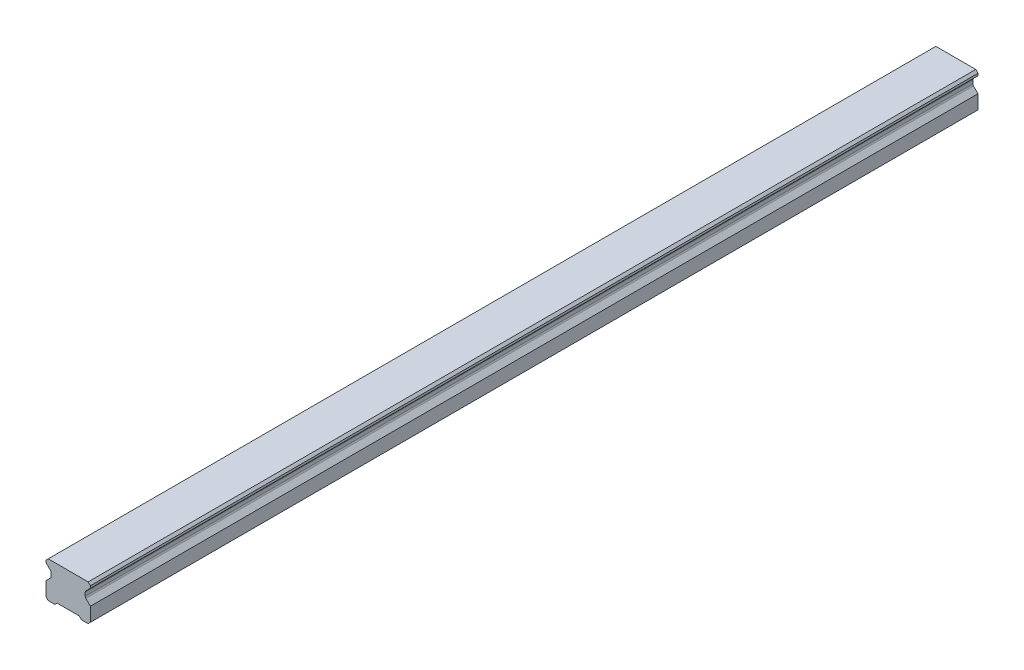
ISO-10303-21;
HEADER;
FILE_DESCRIPTION(('STEP AP214'),'2;1');
FILE_NAME('part.step','',(''),(''),'','','');
FILE_SCHEMA(('AUTOMOTIVE_DESIGN { 1 0 10303 214 1 1 1 1 }'));
ENDSEC;
DATA;
#1=APPLICATION_CONTEXT('core data for automotive mechanical design processes');
#2=APPLICATION_PROTOCOL_DEFINITION('international standard','automotive_design',2000,#1);
#3=PRODUCT_CONTEXT('',#1,'mechanical');
#4=PRODUCT('Part','Part','',(#3));
#5=PRODUCT_RELATED_PRODUCT_CATEGORY('part','',(#4));
#6=PRODUCT_DEFINITION_FORMATION('','',#4);
#7=PRODUCT_DEFINITION_CONTEXT('part definition',#1,'design');
#8=PRODUCT_DEFINITION('design','',#6,#7);
#9=PRODUCT_DEFINITION_SHAPE('','',#8);
#10=(LENGTH_UNIT() NAMED_UNIT(*) SI_UNIT(.MILLI.,.METRE.));
#11=(NAMED_UNIT(*) PLANE_ANGLE_UNIT() SI_UNIT($,.RADIAN.));
#12=(NAMED_UNIT(*) SI_UNIT($,.STERADIAN.) SOLID_ANGLE_UNIT());
#13=UNCERTAINTY_MEASURE_WITH_UNIT(LENGTH_MEASURE(1.E-05),#10,'distance_accuracy_value','');
#14=(GEOMETRIC_REPRESENTATION_CONTEXT(3) GLOBAL_UNCERTAINTY_ASSIGNED_CONTEXT((#13)) GLOBAL_UNIT_ASSIGNED_CONTEXT((#10,
#11,#12)) REPRESENTATION_CONTEXT('',''));
#15=CARTESIAN_POINT('',(0.,0.,0.));
#16=DIRECTION('',(0.,0.,1.));
#17=DIRECTION('',(1.,0.,0.));
#18=AXIS2_PLACEMENT_3D('',#15,#16,#17);
#19=CARTESIAN_POINT('',(0.,11.,-180.));
#20=DIRECTION('',(0.,-1.,0.));
#21=DIRECTION('',(0.,0.,-1.));
#22=AXIS2_PLACEMENT_3D('',#19,#20,#21);
#23=PLANE('',#22);
#24=CARTESIAN_POINT('',(0.,11.,-180.));
#25=DIRECTION('',(0.,-1.,0.));
#26=DIRECTION('',(0.,0.,-1.));
#27=AXIS2_PLACEMENT_3D('',#24,#25,#26);
#28=CIRCLE('',#27,2.5);
#29=CARTESIAN_POINT('',(0.,11.,-182.5));
#30=VERTEX_POINT('',#29);
#31=EDGE_CURVE('E42',#30,#30,#28,.T.);
#32=ORIENTED_EDGE('',*,*,#31,.F.);
#33=EDGE_LOOP('',(#32));
#34=FACE_BOUND('',#33,.T.);
#35=CARTESIAN_POINT('',(0.,11.,-180.));
#36=DIRECTION('',(0.,-1.,0.));
#37=DIRECTION('',(0.,0.,-1.));
#38=AXIS2_PLACEMENT_3D('',#35,#36,#37);
#39=CIRCLE('',#38,3.);
#40=CARTESIAN_POINT('',(0.,11.,-183.));
#41=VERTEX_POINT('',#40);
#42=EDGE_CURVE('E11',#41,#41,#39,.T.);
#43=ORIENTED_EDGE('',*,*,#42,.T.);
#44=EDGE_LOOP('',(#43));
#45=FACE_BOUND('',#44,.T.);
#46=ADVANCED_FACE('F39',(#34,#45),#23,.T.);
#47=CARTESIAN_POINT('',(0.,11.,-180.));
#48=DIRECTION('',(0.,-1.,0.));
#49=DIRECTION('',(0.,0.,-1.));
#50=AXIS2_PLACEMENT_3D('',#47,#48,#49);
#51=CYLINDRICAL_SURFACE('',#50,3.);
#52=ORIENTED_EDGE('',*,*,#42,.F.);
#53=EDGE_LOOP('',(#52));
#54=FACE_BOUND('',#53,.T.);
#55=CARTESIAN_POINT('',(0.,1.00000000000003,-180.));
#56=DIRECTION('',(0.,-1.,0.));
#57=DIRECTION('',(0.,0.,-1.));
#58=AXIS2_PLACEMENT_3D('',#55,#56,#57);
#59=CIRCLE('',#58,3.);
#60=CARTESIAN_POINT('',(0.,1.00000000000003,-183.));
#61=VERTEX_POINT('',#60);
#62=EDGE_CURVE('E48',#61,#61,#59,.T.);
#63=ORIENTED_EDGE('',*,*,#62,.T.);
#64=EDGE_LOOP('',(#63));
#65=FACE_BOUND('',#64,.T.);
#66=ADVANCED_FACE('F576',(#54,#65),#51,.F.);
#67=CARTESIAN_POINT('',(0.,11.,-120.));
#68=DIRECTION('',(0.,-1.,0.));
#69=DIRECTION('',(0.,0.,-1.));
#70=AXIS2_PLACEMENT_3D('',#67,#68,#69);
#71=PLANE('',#70);
#72=CARTESIAN_POINT('',(0.,11.,-120.));
#73=DIRECTION('',(0.,-1.,0.));
#74=DIRECTION('',(0.,0.,-1.));
#75=AXIS2_PLACEMENT_3D('',#72,#73,#74);
#76=CIRCLE('',#75,2.5);
#77=CARTESIAN_POINT('',(0.,11.,-122.5));
#78=VERTEX_POINT('',#77);
#79=EDGE_CURVE('E563',#78,#78,#76,.T.);
#80=ORIENTED_EDGE('',*,*,#79,.F.);
#81=EDGE_LOOP('',(#80));
#82=FACE_BOUND('',#81,.T.);
#83=CARTESIAN_POINT('',(0.,11.,-120.));
#84=DIRECTION('',(0.,-1.,0.));
#85=DIRECTION('',(0.,0.,-1.));
#86=AXIS2_PLACEMENT_3D('',#83,#84,#85);
#87=CIRCLE('',#86,3.);
#88=CARTESIAN_POINT('',(0.,11.,-123.));
#89=VERTEX_POINT('',#88);
#90=EDGE_CURVE('E546',#89,#89,#87,.T.);
#91=ORIENTED_EDGE('',*,*,#90,.T.);
#92=EDGE_LOOP('',(#91));
#93=FACE_BOUND('',#92,.T.);
#94=ADVANCED_FACE('F581',(#82,#93),#71,.T.);
#95=CARTESIAN_POINT('',(0.,11.,-120.));
#96=DIRECTION('',(0.,-1.,0.));
#97=DIRECTION('',(0.,0.,-1.));
#98=AXIS2_PLACEMENT_3D('',#95,#96,#97);
#99=CYLINDRICAL_SURFACE('',#98,3.);
#100=ORIENTED_EDGE('',*,*,#90,.F.);
#101=EDGE_LOOP('',(#100));
#102=FACE_BOUND('',#101,.T.);
#103=CARTESIAN_POINT('',(0.,1.00000000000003,-120.));
#104=DIRECTION('',(0.,-1.,0.));
#105=DIRECTION('',(0.,0.,-1.));
#106=AXIS2_PLACEMENT_3D('',#103,#104,#105);
#107=CIRCLE('',#106,3.);
#108=CARTESIAN_POINT('',(0.,1.00000000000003,-123.));
#109=VERTEX_POINT('',#108);
#110=EDGE_CURVE('E542',#109,#109,#107,.T.);
#111=ORIENTED_EDGE('',*,*,#110,.T.);
#112=EDGE_LOOP('',(#111));
#113=FACE_BOUND('',#112,.T.);
#114=ADVANCED_FACE('F708',(#102,#113),#99,.F.);
#115=CARTESIAN_POINT('',(0.,11.,-60.));
#116=DIRECTION('',(0.,-1.,0.));
#117=DIRECTION('',(0.,0.,-1.));
#118=AXIS2_PLACEMENT_3D('',#115,#116,#117);
#119=PLANE('',#118);
#120=CARTESIAN_POINT('',(0.,11.,-60.));
#121=DIRECTION('',(0.,-1.,0.));
#122=DIRECTION('',(0.,0.,-1.));
#123=AXIS2_PLACEMENT_3D('',#120,#121,#122);
#124=CIRCLE('',#123,2.5);
#125=CARTESIAN_POINT('',(0.,11.,-62.5));
#126=VERTEX_POINT('',#125);
#127=EDGE_CURVE('E560',#126,#126,#124,.T.);
#128=ORIENTED_EDGE('',*,*,#127,.F.);
#129=EDGE_LOOP('',(#128));
#130=FACE_BOUND('',#129,.T.);
#131=CARTESIAN_POINT('',(0.,11.,-60.));
#132=DIRECTION('',(0.,-1.,0.));
#133=DIRECTION('',(0.,0.,-1.));
#134=AXIS2_PLACEMENT_3D('',#131,#132,#133);
#135=CIRCLE('',#134,3.);
#136=CARTESIAN_POINT('',(0.,11.,-63.));
#137=VERTEX_POINT('',#136);
#138=EDGE_CURVE('E538',#137,#137,#135,.T.);
#139=ORIENTED_EDGE('',*,*,#138,.T.);
#140=EDGE_LOOP('',(#139));
#141=FACE_BOUND('',#140,.T.);
#142=ADVANCED_FACE('F704',(#130,#141),#119,.T.);
#143=CARTESIAN_POINT('',(0.,11.,-60.));
#144=DIRECTION('',(0.,-1.,0.));
#145=DIRECTION('',(0.,0.,-1.));
#146=AXIS2_PLACEMENT_3D('',#143,#144,#145);
#147=CYLINDRICAL_SURFACE('',#146,3.);
#148=ORIENTED_EDGE('',*,*,#138,.F.);
#149=EDGE_LOOP('',(#148));
#150=FACE_BOUND('',#149,.T.);
#151=CARTESIAN_POINT('',(0.,1.00000000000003,-60.));
#152=DIRECTION('',(0.,-1.,0.));
#153=DIRECTION('',(0.,0.,-1.));
#154=AXIS2_PLACEMENT_3D('',#151,#152,#153);
#155=CIRCLE('',#154,3.);
#156=CARTESIAN_POINT('',(0.,1.00000000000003,-63.));
#157=VERTEX_POINT('',#156);
#158=EDGE_CURVE('E534',#157,#157,#155,.T.);
#159=ORIENTED_EDGE('',*,*,#158,.T.);
#160=EDGE_LOOP('',(#159));
#161=FACE_BOUND('',#160,.T.);
#162=ADVANCED_FACE('F700',(#150,#161),#147,.F.);
#163=CARTESIAN_POINT('',(0.,11.,0.));
#164=DIRECTION('',(0.,-1.,0.));
#165=DIRECTION('',(0.,0.,-1.));
#166=AXIS2_PLACEMENT_3D('',#163,#164,#165);
#167=PLANE('',#166);
#168=CARTESIAN_POINT('',(0.,11.,0.));
#169=DIRECTION('',(0.,-1.,0.));
#170=DIRECTION('',(0.,0.,-1.));
#171=AXIS2_PLACEMENT_3D('',#168,#169,#170);
#172=CIRCLE('',#171,2.5);
#173=CARTESIAN_POINT('',(0.,11.,-2.49999999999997));
#174=VERTEX_POINT('',#173);
#175=EDGE_CURVE('E556',#174,#174,#172,.T.);
#176=ORIENTED_EDGE('',*,*,#175,.F.);
#177=EDGE_LOOP('',(#176));
#178=FACE_BOUND('',#177,.T.);
#179=CARTESIAN_POINT('',(0.,11.,0.));
#180=DIRECTION('',(0.,-1.,0.));
#181=DIRECTION('',(0.,0.,-1.));
#182=AXIS2_PLACEMENT_3D('',#179,#180,#181);
#183=CIRCLE('',#182,3.);
#184=CARTESIAN_POINT('',(0.,11.,-2.99999999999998));
#185=VERTEX_POINT('',#184);
#186=EDGE_CURVE('E530',#185,#185,#183,.T.);
#187=ORIENTED_EDGE('',*,*,#186,.T.);
#188=EDGE_LOOP('',(#187));
#189=FACE_BOUND('',#188,.T.);
#190=ADVANCED_FACE('F696',(#178,#189),#167,.T.);
#191=CARTESIAN_POINT('',(0.,11.,0.));
#192=DIRECTION('',(0.,-1.,0.));
#193=DIRECTION('',(0.,0.,-1.));
#194=AXIS2_PLACEMENT_3D('',#191,#192,#193);
#195=CYLINDRICAL_SURFACE('',#194,3.);
#196=ORIENTED_EDGE('',*,*,#186,.F.);
#197=EDGE_LOOP('',(#196));
#198=FACE_BOUND('',#197,.T.);
#199=CARTESIAN_POINT('',(0.,1.00000000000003,0.));
#200=DIRECTION('',(0.,-1.,0.));
#201=DIRECTION('',(0.,0.,-1.));
#202=AXIS2_PLACEMENT_3D('',#199,#200,#201);
#203=CIRCLE('',#202,3.);
#204=CARTESIAN_POINT('',(0.,1.00000000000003,-2.99999999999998));
#205=VERTEX_POINT('',#204);
#206=EDGE_CURVE('E526',#205,#205,#203,.T.);
#207=ORIENTED_EDGE('',*,*,#206,.T.);
#208=EDGE_LOOP('',(#207));
#209=FACE_BOUND('',#208,.T.);
#210=ADVANCED_FACE('F692',(#198,#209),#195,.F.);
#211=CARTESIAN_POINT('',(0.,11.,60.));
#212=DIRECTION('',(0.,-1.,0.));
#213=DIRECTION('',(0.,0.,-1.));
#214=AXIS2_PLACEMENT_3D('',#211,#212,#213);
#215=PLANE('',#214);
#216=CARTESIAN_POINT('',(0.,11.,60.));
#217=DIRECTION('',(0.,-1.,0.));
#218=DIRECTION('',(0.,0.,-1.));
#219=AXIS2_PLACEMENT_3D('',#216,#217,#218);
#220=CIRCLE('',#219,2.5);
#221=CARTESIAN_POINT('',(0.,11.,57.5));
#222=VERTEX_POINT('',#221);
#223=EDGE_CURVE('E239',#222,#222,#220,.T.);
#224=ORIENTED_EDGE('',*,*,#223,.F.);
#225=EDGE_LOOP('',(#224));
#226=FACE_BOUND('',#225,.T.);
#227=CARTESIAN_POINT('',(0.,11.,60.));
#228=DIRECTION('',(0.,-1.,0.));
#229=DIRECTION('',(0.,0.,-1.));
#230=AXIS2_PLACEMENT_3D('',#227,#228,#229);
#231=CIRCLE('',#230,3.);
#232=CARTESIAN_POINT('',(0.,11.,57.));
#233=VERTEX_POINT('',#232);
#234=EDGE_CURVE('E522',#233,#233,#231,.T.);
#235=ORIENTED_EDGE('',*,*,#234,.T.);
#236=EDGE_LOOP('',(#235));
#237=FACE_BOUND('',#236,.T.);
#238=ADVANCED_FACE('F688',(#226,#237),#215,.T.);
#239=CARTESIAN_POINT('',(0.,11.,60.));
#240=DIRECTION('',(0.,-1.,0.));
#241=DIRECTION('',(0.,0.,-1.));
#242=AXIS2_PLACEMENT_3D('',#239,#240,#241);
#243=CYLINDRICAL_SURFACE('',#242,3.);
#244=ORIENTED_EDGE('',*,*,#234,.F.);
#245=EDGE_LOOP('',(#244));
#246=FACE_BOUND('',#245,.T.);
#247=CARTESIAN_POINT('',(0.,1.00000000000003,60.));
#248=DIRECTION('',(0.,-1.,0.));
#249=DIRECTION('',(0.,0.,-1.));
#250=AXIS2_PLACEMENT_3D('',#247,#248,#249);
#251=CIRCLE('',#250,3.);
#252=CARTESIAN_POINT('',(0.,1.00000000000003,57.));
#253=VERTEX_POINT('',#252);
#254=EDGE_CURVE('E518',#253,#253,#251,.T.);
#255=ORIENTED_EDGE('',*,*,#254,.T.);
#256=EDGE_LOOP('',(#255));
#257=FACE_BOUND('',#256,.T.);
#258=ADVANCED_FACE('F685',(#246,#257),#243,.F.);
#259=CARTESIAN_POINT('',(10.,0.,200.));
#260=DIRECTION('',(0.,1.,0.));
#261=DIRECTION('',(-1.,0.,0.));
#262=AXIS2_PLACEMENT_3D('',#259,#260,#261);
#263=PLANE('',#262);
#264=DIRECTION('',(1.,0.,0.));
#265=VECTOR('',#264,1.);
#266=CARTESIAN_POINT('',(10.,0.,-200.));
#267=LINE('',#266,#265);
#268=CARTESIAN_POINT('',(-8.99999999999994,0.,-200.));
#269=VERTEX_POINT('',#268);
#270=CARTESIAN_POINT('',(-6.00000000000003,0.,-200.));
#271=VERTEX_POINT('',#270);
#272=EDGE_CURVE('E402',#269,#271,#267,.T.);
#273=ORIENTED_EDGE('',*,*,#272,.T.);
#274=DIRECTION('',(0.,0.,1.));
#275=VECTOR('',#274,1.);
#276=CARTESIAN_POINT('',(-6.00000000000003,0.,-200.));
#277=LINE('',#276,#275);
#278=CARTESIAN_POINT('',(-6.00000000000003,0.,200.));
#279=VERTEX_POINT('',#278);
#280=EDGE_CURVE('E307',#271,#279,#277,.T.);
#281=ORIENTED_EDGE('',*,*,#280,.T.);
#282=DIRECTION('',(1.,0.,0.));
#283=VECTOR('',#282,1.);
#284=CARTESIAN_POINT('',(10.,0.,200.));
#285=LINE('',#284,#283);
#286=CARTESIAN_POINT('',(-8.99999999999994,0.,200.));
#287=VERTEX_POINT('',#286);
#288=EDGE_CURVE('E383',#287,#279,#285,.T.);
#289=ORIENTED_EDGE('',*,*,#288,.F.);
#290=DIRECTION('',(0.,0.,-1.));
#291=VECTOR('',#290,1.);
#292=CARTESIAN_POINT('',(-8.99999999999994,0.,200.));
#293=LINE('',#292,#291);
#294=EDGE_CURVE('E454',#287,#269,#293,.T.);
#295=ORIENTED_EDGE('',*,*,#294,.T.);
#296=EDGE_LOOP('',(#273,#281,#289,#295));
#297=FACE_BOUND('',#296,.T.);
#298=ADVANCED_FACE('F650',(#297),#263,.F.);
#299=CARTESIAN_POINT('',(-10.,16.3,200.));
#300=DIRECTION('',(1.,0.,0.));
#301=DIRECTION('',(0.,1.,0.));
#302=AXIS2_PLACEMENT_3D('',#299,#300,#301);
#303=PLANE('',#302);
#304=DIRECTION('',(0.,-1.,0.));
#305=VECTOR('',#304,1.);
#306=CARTESIAN_POINT('',(-10.,16.3,200.));
#307=LINE('',#306,#305);
#308=CARTESIAN_POINT('',(-10.,15.3,200.));
#309=VERTEX_POINT('',#308);
#310=CARTESIAN_POINT('',(-10.,14.3,200.));
#311=VERTEX_POINT('',#310);
#312=EDGE_CURVE('E377',#309,#311,#307,.T.);
#313=ORIENTED_EDGE('',*,*,#312,.F.);
#314=DIRECTION('',(0.,0.,-1.));
#315=VECTOR('',#314,1.);
#316=CARTESIAN_POINT('',(-10.,15.3,200.));
#317=LINE('',#316,#315);
#318=CARTESIAN_POINT('',(-10.,15.3,-200.));
#319=VERTEX_POINT('',#318);
#320=EDGE_CURVE('E396',#309,#319,#317,.T.);
#321=ORIENTED_EDGE('',*,*,#320,.T.);
#322=DIRECTION('',(0.,-1.,0.));
#323=VECTOR('',#322,1.);
#324=CARTESIAN_POINT('',(-10.,16.3,-200.));
#325=LINE('',#324,#323);
#326=CARTESIAN_POINT('',(-10.,14.3,-200.));
#327=VERTEX_POINT('',#326);
#328=EDGE_CURVE('E397',#319,#327,#325,.T.);
#329=ORIENTED_EDGE('',*,*,#328,.T.);
#330=DIRECTION('',(0.,0.,1.));
#331=VECTOR('',#330,1.);
#332=CARTESIAN_POINT('',(-10.,14.3,-200.));
#333=LINE('',#332,#331);
#334=EDGE_CURVE('E331',#327,#311,#333,.T.);
#335=ORIENTED_EDGE('',*,*,#334,.T.);
#336=EDGE_LOOP('',(#313,#321,#329,#335));
#337=FACE_BOUND('',#336,.T.);
#338=ADVANCED_FACE('F654',(#337),#303,.F.);
#339=CARTESIAN_POINT('',(10.,16.3,200.));
#340=DIRECTION('',(-1.,0.,0.));
#341=DIRECTION('',(0.,-1.,0.));
#342=AXIS2_PLACEMENT_3D('',#339,#340,#341);
#343=PLANE('',#342);
#344=DIRECTION('',(0.,1.,0.));
#345=VECTOR('',#344,1.);
#346=CARTESIAN_POINT('',(10.,16.3,200.));
#347=LINE('',#346,#345);
#348=CARTESIAN_POINT('',(10.,1.,200.));
#349=VERTEX_POINT('',#348);
#350=CARTESIAN_POINT('',(10.,7.3,200.));
#351=VERTEX_POINT('',#350);
#352=EDGE_CURVE('E388',#349,#351,#347,.T.);
#353=ORIENTED_EDGE('',*,*,#352,.F.);
#354=DIRECTION('',(0.,0.,-1.));
#355=VECTOR('',#354,1.);
#356=CARTESIAN_POINT('',(10.,1.,200.));
#357=LINE('',#356,#355);
#358=CARTESIAN_POINT('',(10.,1.,-200.));
#359=VERTEX_POINT('',#358);
#360=EDGE_CURVE('E461',#349,#359,#357,.T.);
#361=ORIENTED_EDGE('',*,*,#360,.T.);
#362=DIRECTION('',(0.,1.,0.));
#363=VECTOR('',#362,1.);
#364=CARTESIAN_POINT('',(10.,16.3,-200.));
#365=LINE('',#364,#363);
#366=CARTESIAN_POINT('',(10.,7.3,-200.));
#367=VERTEX_POINT('',#366);
#368=EDGE_CURVE('E407',#359,#367,#365,.T.);
#369=ORIENTED_EDGE('',*,*,#368,.T.);
#370=DIRECTION('',(0.,0.,1.));
#371=VECTOR('',#370,1.);
#372=CARTESIAN_POINT('',(10.,7.3,-200.));
#373=LINE('',#372,#371);
#374=EDGE_CURVE('E362',#367,#351,#373,.T.);
#375=ORIENTED_EDGE('',*,*,#374,.T.);
#376=EDGE_LOOP('',(#353,#361,#369,#375));
#377=FACE_BOUND('',#376,.T.);
#378=ADVANCED_FACE('F645',(#377),#343,.F.);
#379=CARTESIAN_POINT('',(-10.,7.3,-200.));
#380=VERTEX_POINT('',#379);
#381=CARTESIAN_POINT('',(-10.,0.999999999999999,-200.));
#382=VERTEX_POINT('',#381);
#383=EDGE_CURVE('E346',#380,#382,#325,.T.);
#384=ORIENTED_EDGE('',*,*,#383,.T.);
#385=DIRECTION('',(0.,0.,1.));
#386=VECTOR('',#385,1.);
#387=CARTESIAN_POINT('',(-10.,0.999999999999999,200.));
#388=LINE('',#387,#386);
#389=CARTESIAN_POINT('',(-10.,0.999999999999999,200.));
#390=VERTEX_POINT('',#389);
#391=EDGE_CURVE('E458',#382,#390,#388,.T.);
#392=ORIENTED_EDGE('',*,*,#391,.T.);
#393=CARTESIAN_POINT('',(-10.,7.3,200.));
#394=VERTEX_POINT('',#393);
#395=EDGE_CURVE('E382',#394,#390,#307,.T.);
#396=ORIENTED_EDGE('',*,*,#395,.F.);
#397=DIRECTION('',(0.,0.,1.));
#398=VECTOR('',#397,1.);
#399=CARTESIAN_POINT('',(-10.,7.3,-200.));
#400=LINE('',#399,#398);
#401=EDGE_CURVE('E343',#380,#394,#400,.T.);
#402=ORIENTED_EDGE('',*,*,#401,.F.);
#403=EDGE_LOOP('',(#384,#392,#396,#402));
#404=FACE_BOUND('',#403,.T.);
#405=ADVANCED_FACE('F648',(#404),#303,.F.);
#406=CARTESIAN_POINT('',(6.00000000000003,0.,200.));
#407=VERTEX_POINT('',#406);
#408=CARTESIAN_POINT('',(9.,0.,200.));
#409=VERTEX_POINT('',#408);
#410=EDGE_CURVE('E381',#407,#409,#285,.T.);
#411=ORIENTED_EDGE('',*,*,#410,.F.);
#412=DIRECTION('',(0.,0.,1.));
#413=VECTOR('',#412,1.);
#414=CARTESIAN_POINT('',(6.00000000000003,0.,-200.));
#415=LINE('',#414,#413);
#416=CARTESIAN_POINT('',(6.00000000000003,0.,-200.));
#417=VERTEX_POINT('',#416);
#418=EDGE_CURVE('E297',#417,#407,#415,.T.);
#419=ORIENTED_EDGE('',*,*,#418,.F.);
#420=CARTESIAN_POINT('',(9.,0.,-200.));
#421=VERTEX_POINT('',#420);
#422=EDGE_CURVE('E401',#417,#421,#267,.T.);
#423=ORIENTED_EDGE('',*,*,#422,.T.);
#424=DIRECTION('',(0.,0.,1.));
#425=VECTOR('',#424,1.);
#426=CARTESIAN_POINT('',(9.,0.,200.));
#427=LINE('',#426,#425);
#428=EDGE_CURVE('E450',#421,#409,#427,.T.);
#429=ORIENTED_EDGE('',*,*,#428,.T.);
#430=EDGE_LOOP('',(#411,#419,#423,#429));
#431=FACE_BOUND('',#430,.T.);
#432=ADVANCED_FACE('F643',(#431),#263,.F.);
#433=CARTESIAN_POINT('',(10.,14.3,-200.));
#434=VERTEX_POINT('',#433);
#435=CARTESIAN_POINT('',(10.,15.3,-200.));
#436=VERTEX_POINT('',#435);
#437=EDGE_CURVE('E406',#434,#436,#365,.T.);
#438=ORIENTED_EDGE('',*,*,#437,.T.);
#439=DIRECTION('',(0.,0.,1.));
#440=VECTOR('',#439,1.);
#441=CARTESIAN_POINT('',(10.,15.3,200.));
#442=LINE('',#441,#440);
#443=CARTESIAN_POINT('',(10.,15.3,200.));
#444=VERTEX_POINT('',#443);
#445=EDGE_CURVE('E465',#436,#444,#442,.T.);
#446=ORIENTED_EDGE('',*,*,#445,.T.);
#447=CARTESIAN_POINT('',(10.,14.3,200.));
#448=VERTEX_POINT('',#447);
#449=EDGE_CURVE('E387',#448,#444,#347,.T.);
#450=ORIENTED_EDGE('',*,*,#449,.F.);
#451=DIRECTION('',(0.,0.,1.));
#452=VECTOR('',#451,1.);
#453=CARTESIAN_POINT('',(10.,14.3,-200.));
#454=LINE('',#453,#452);
#455=EDGE_CURVE('E336',#434,#448,#454,.T.);
#456=ORIENTED_EDGE('',*,*,#455,.F.);
#457=EDGE_LOOP('',(#438,#446,#450,#456));
#458=FACE_BOUND('',#457,.T.);
#459=ADVANCED_FACE('F639',(#458),#343,.F.);
#460=CARTESIAN_POINT('',(10.,16.3,200.));
#461=DIRECTION('',(0.,-1.,0.));
#462=DIRECTION('',(0.,0.,-1.));
#463=AXIS2_PLACEMENT_3D('',#460,#461,#462);
#464=PLANE('',#463);
#465=DIRECTION('',(-1.,0.,0.));
#466=VECTOR('',#465,1.);
#467=CARTESIAN_POINT('',(10.,16.3,-200.));
#468=LINE('',#467,#466);
#469=CARTESIAN_POINT('',(8.99999999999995,16.3,-200.));
#470=VERTEX_POINT('',#469);
#471=CARTESIAN_POINT('',(-9.,16.3,-200.));
#472=VERTEX_POINT('',#471);
#473=EDGE_CURVE('E411',#470,#472,#468,.T.);
#474=ORIENTED_EDGE('',*,*,#473,.T.);
#475=DIRECTION('',(0.,0.,1.));
#476=VECTOR('',#475,1.);
#477=CARTESIAN_POINT('',(-9.,16.3,200.));
#478=LINE('',#477,#476);
#479=CARTESIAN_POINT('',(-9.,16.3,200.));
#480=VERTEX_POINT('',#479);
#481=EDGE_CURVE('E435',#472,#480,#478,.T.);
#482=ORIENTED_EDGE('',*,*,#481,.T.);
#483=DIRECTION('',(-1.,0.,0.));
#484=VECTOR('',#483,1.);
#485=CARTESIAN_POINT('',(10.,16.3,200.));
#486=LINE('',#485,#484);
#487=CARTESIAN_POINT('',(8.99999999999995,16.3,200.));
#488=VERTEX_POINT('',#487);
#489=EDGE_CURVE('E392',#488,#480,#486,.T.);
#490=ORIENTED_EDGE('',*,*,#489,.F.);
#491=DIRECTION('',(0.,0.,-1.));
#492=VECTOR('',#491,1.);
#493=CARTESIAN_POINT('',(8.99999999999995,16.3,200.));
#494=LINE('',#493,#492);
#495=EDGE_CURVE('E431',#488,#470,#494,.T.);
#496=ORIENTED_EDGE('',*,*,#495,.T.);
#497=EDGE_LOOP('',(#474,#482,#490,#496));
#498=FACE_BOUND('',#497,.T.);
#499=ADVANCED_FACE('F633',(#498),#464,.F.);
#500=CARTESIAN_POINT('',(0.,0.,200.));
#501=DIRECTION('',(0.,0.,-1.));
#502=DIRECTION('',(-1.,0.,0.));
#503=AXIS2_PLACEMENT_3D('',#500,#501,#502);
#504=PLANE('',#503);
#505=ORIENTED_EDGE('',*,*,#288,.T.);
#506=DIRECTION('',(-0.707106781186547,-0.707106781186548,0.));
#507=VECTOR('',#506,1.);
#508=CARTESIAN_POINT('',(-6.00000000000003,0.,200.));
#509=LINE('',#508,#507);
#510=CARTESIAN_POINT('',(-5.,1.00000000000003,200.));
#511=VERTEX_POINT('',#510);
#512=EDGE_CURVE('E290',#511,#279,#509,.T.);
#513=ORIENTED_EDGE('',*,*,#512,.F.);
#514=DIRECTION('',(-1.,0.,0.));
#515=VECTOR('',#514,1.);
#516=CARTESIAN_POINT('',(-5.,1.00000000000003,200.));
#517=LINE('',#516,#515);
#518=CARTESIAN_POINT('',(5.,1.00000000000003,200.));
#519=VERTEX_POINT('',#518);
#520=EDGE_CURVE('E301',#519,#511,#517,.T.);
#521=ORIENTED_EDGE('',*,*,#520,.F.);
#522=DIRECTION('',(-0.707106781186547,0.707106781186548,0.));
#523=VECTOR('',#522,1.);
#524=CARTESIAN_POINT('',(5.,1.00000000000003,200.));
#525=LINE('',#524,#523);
#526=EDGE_CURVE('E282',#407,#519,#525,.T.);
#527=ORIENTED_EDGE('',*,*,#526,.F.);
#528=ORIENTED_EDGE('',*,*,#410,.T.);
#529=DIRECTION('',(-0.707106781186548,-0.707106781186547,0.));
#530=VECTOR('',#529,1.);
#531=CARTESIAN_POINT('',(10.,1.,200.));
#532=LINE('',#531,#530);
#533=EDGE_CURVE('E441',#409,#349,#532,.F.);
#534=ORIENTED_EDGE('',*,*,#533,.T.);
#535=ORIENTED_EDGE('',*,*,#352,.T.);
#536=DIRECTION('',(0.707106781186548,-0.707106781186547,0.));
#537=VECTOR('',#536,1.);
#538=CARTESIAN_POINT('',(10.,7.3,200.));
#539=LINE('',#538,#537);
#540=CARTESIAN_POINT('',(7.95955988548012,9.34044011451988,200.));
#541=VERTEX_POINT('',#540);
#542=EDGE_CURVE('E311',#541,#351,#539,.T.);
#543=ORIENTED_EDGE('',*,*,#542,.F.);
#544=CARTESIAN_POINT('',(8.66666666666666,10.0475468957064,200.));
#545=DIRECTION('',(0.,0.,-1.));
#546=DIRECTION('',(-1.,0.,0.));
#547=AXIS2_PLACEMENT_3D('',#544,#545,#546);
#548=CIRCLE('',#547,1.);
#549=CARTESIAN_POINT('',(7.66666666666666,10.0475468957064,200.));
#550=VERTEX_POINT('',#549);
#551=EDGE_CURVE('E495',#541,#550,#548,.T.);
#552=ORIENTED_EDGE('',*,*,#551,.T.);
#553=DIRECTION('',(0.,-1.,0.));
#554=VECTOR('',#553,1.);
#555=CARTESIAN_POINT('',(7.66666666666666,9.63333333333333,200.));
#556=LINE('',#555,#554);
#557=CARTESIAN_POINT('',(7.66666666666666,11.5524531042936,200.));
#558=VERTEX_POINT('',#557);
#559=EDGE_CURVE('E354',#558,#550,#556,.T.);
#560=ORIENTED_EDGE('',*,*,#559,.F.);
#561=CARTESIAN_POINT('',(8.66666666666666,11.5524531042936,200.));
#562=DIRECTION('',(0.,0.,-1.));
#563=DIRECTION('',(-1.,0.,0.));
#564=AXIS2_PLACEMENT_3D('',#561,#562,#563);
#565=CIRCLE('',#564,1.);
#566=CARTESIAN_POINT('',(7.95955988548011,12.2595598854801,200.));
#567=VERTEX_POINT('',#566);
#568=EDGE_CURVE('E501',#558,#567,#565,.T.);
#569=ORIENTED_EDGE('',*,*,#568,.T.);
#570=DIRECTION('',(-0.707106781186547,-0.707106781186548,0.));
#571=VECTOR('',#570,1.);
#572=CARTESIAN_POINT('',(7.66666666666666,11.9666666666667,200.));
#573=LINE('',#572,#571);
#574=EDGE_CURVE('E365',#448,#567,#573,.T.);
#575=ORIENTED_EDGE('',*,*,#574,.F.);
#576=ORIENTED_EDGE('',*,*,#449,.T.);
#577=DIRECTION('',(0.707106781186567,-0.707106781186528,0.));
#578=VECTOR('',#577,1.);
#579=CARTESIAN_POINT('',(8.99999999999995,16.3,200.));
#580=LINE('',#579,#578);
#581=EDGE_CURVE('E438',#444,#488,#580,.F.);
#582=ORIENTED_EDGE('',*,*,#581,.T.);
#583=ORIENTED_EDGE('',*,*,#489,.T.);
#584=DIRECTION('',(0.707106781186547,0.707106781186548,0.));
#585=VECTOR('',#584,1.);
#586=CARTESIAN_POINT('',(-10.,15.3,200.));
#587=LINE('',#586,#585);
#588=EDGE_CURVE('E447',#480,#309,#587,.F.);
#589=ORIENTED_EDGE('',*,*,#588,.T.);
#590=ORIENTED_EDGE('',*,*,#312,.T.);
#591=DIRECTION('',(-0.707106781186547,0.707106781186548,0.));
#592=VECTOR('',#591,1.);
#593=CARTESIAN_POINT('',(-7.66666666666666,11.9666666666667,200.));
#594=LINE('',#593,#592);
#595=CARTESIAN_POINT('',(-7.95955988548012,12.2595598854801,200.));
#596=VERTEX_POINT('',#595);
#597=EDGE_CURVE('E332',#596,#311,#594,.T.);
#598=ORIENTED_EDGE('',*,*,#597,.F.);
#599=CARTESIAN_POINT('',(-8.66666666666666,11.5524531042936,200.));
#600=DIRECTION('',(0.,0.,-1.));
#601=DIRECTION('',(-1.,0.,0.));
#602=AXIS2_PLACEMENT_3D('',#599,#600,#601);
#603=CIRCLE('',#602,1.);
#604=CARTESIAN_POINT('',(-7.66666666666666,11.5524531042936,200.));
#605=VERTEX_POINT('',#604);
#606=EDGE_CURVE('E513',#596,#605,#603,.T.);
#607=ORIENTED_EDGE('',*,*,#606,.T.);
#608=DIRECTION('',(0.,1.,0.));
#609=VECTOR('',#608,1.);
#610=CARTESIAN_POINT('',(-7.66666666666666,9.63333333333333,200.));
#611=LINE('',#610,#609);
#612=CARTESIAN_POINT('',(-7.66666666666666,10.0475468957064,200.));
#613=VERTEX_POINT('',#612);
#614=EDGE_CURVE('E324',#613,#605,#611,.T.);
#615=ORIENTED_EDGE('',*,*,#614,.F.);
#616=CARTESIAN_POINT('',(-8.66666666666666,10.0475468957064,200.));
#617=DIRECTION('',(0.,0.,-1.));
#618=DIRECTION('',(-1.,0.,0.));
#619=AXIS2_PLACEMENT_3D('',#616,#617,#618);
#620=CIRCLE('',#619,1.);
#621=CARTESIAN_POINT('',(-7.95955988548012,9.34044011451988,200.));
#622=VERTEX_POINT('',#621);
#623=EDGE_CURVE('E507',#613,#622,#620,.T.);
#624=ORIENTED_EDGE('',*,*,#623,.T.);
#625=DIRECTION('',(0.707106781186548,0.707106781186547,0.));
#626=VECTOR('',#625,1.);
#627=CARTESIAN_POINT('',(-10.,7.3,200.));
#628=LINE('',#627,#626);
#629=EDGE_CURVE('E335',#394,#622,#628,.T.);
#630=ORIENTED_EDGE('',*,*,#629,.F.);
#631=ORIENTED_EDGE('',*,*,#395,.T.);
#632=DIRECTION('',(-0.707106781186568,0.707106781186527,0.));
#633=VECTOR('',#632,1.);
#634=CARTESIAN_POINT('',(-8.99999999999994,0.,200.));
#635=LINE('',#634,#633);
#636=EDGE_CURVE('E444',#390,#287,#635,.F.);
#637=ORIENTED_EDGE('',*,*,#636,.T.);
#638=EDGE_LOOP('',(#505,#513,#521,#527,#528,#534,#535,#543,#552,#560,#569,#575,#576,#582,#583,
#589,#590,#598,#607,#615,#624,#630,#631,#637));
#639=FACE_BOUND('',#638,.T.);
#640=ADVANCED_FACE('F630',(#639),#504,.F.);
#641=CARTESIAN_POINT('',(0.,0.,-200.));
#642=DIRECTION('',(0.,0.,-1.));
#643=DIRECTION('',(-1.,0.,0.));
#644=AXIS2_PLACEMENT_3D('',#641,#642,#643);
#645=PLANE('',#644);
#646=DIRECTION('',(-0.707106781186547,-0.707106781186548,0.));
#647=VECTOR('',#646,1.);
#648=CARTESIAN_POINT('',(-6.00000000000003,0.,-200.));
#649=LINE('',#648,#647);
#650=CARTESIAN_POINT('',(-5.,1.00000000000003,-200.));
#651=VERTEX_POINT('',#650);
#652=EDGE_CURVE('E293',#651,#271,#649,.T.);
#653=ORIENTED_EDGE('',*,*,#652,.T.);
#654=ORIENTED_EDGE('',*,*,#272,.F.);
#655=DIRECTION('',(0.707106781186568,-0.707106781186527,0.));
#656=VECTOR('',#655,1.);
#657=CARTESIAN_POINT('',(-4.49999999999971,-4.49999999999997,-200.));
#658=LINE('',#657,#656);
#659=EDGE_CURVE('E425',#269,#382,#658,.F.);
#660=ORIENTED_EDGE('',*,*,#659,.T.);
#661=ORIENTED_EDGE('',*,*,#383,.F.);
#662=DIRECTION('',(0.707106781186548,0.707106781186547,0.));
#663=VECTOR('',#662,1.);
#664=CARTESIAN_POINT('',(-10.,7.3,-200.));
#665=LINE('',#664,#663);
#666=CARTESIAN_POINT('',(-7.95955988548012,9.34044011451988,-200.));
#667=VERTEX_POINT('',#666);
#668=EDGE_CURVE('E323',#380,#667,#665,.T.);
#669=ORIENTED_EDGE('',*,*,#668,.T.);
#670=CARTESIAN_POINT('',(-8.66666666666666,10.0475468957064,-200.));
#671=DIRECTION('',(0.,0.,-1.));
#672=DIRECTION('',(-1.,0.,0.));
#673=AXIS2_PLACEMENT_3D('',#670,#671,#672);
#674=CIRCLE('',#673,1.);
#675=CARTESIAN_POINT('',(-7.66666666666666,10.0475468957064,-200.));
#676=VERTEX_POINT('',#675);
#677=EDGE_CURVE('E510',#667,#676,#674,.F.);
#678=ORIENTED_EDGE('',*,*,#677,.T.);
#679=DIRECTION('',(0.,1.,0.));
#680=VECTOR('',#679,1.);
#681=CARTESIAN_POINT('',(-7.66666666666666,9.63333333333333,-200.));
#682=LINE('',#681,#680);
#683=CARTESIAN_POINT('',(-7.66666666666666,11.5524531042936,-200.));
#684=VERTEX_POINT('',#683);
#685=EDGE_CURVE('E328',#676,#684,#682,.T.);
#686=ORIENTED_EDGE('',*,*,#685,.T.);
#687=CARTESIAN_POINT('',(-8.66666666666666,11.5524531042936,-200.));
#688=DIRECTION('',(0.,0.,-1.));
#689=DIRECTION('',(-1.,0.,0.));
#690=AXIS2_PLACEMENT_3D('',#687,#688,#689);
#691=CIRCLE('',#690,1.);
#692=CARTESIAN_POINT('',(-7.95955988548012,12.2595598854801,-200.));
#693=VERTEX_POINT('',#692);
#694=EDGE_CURVE('E64',#684,#693,#691,.F.);
#695=ORIENTED_EDGE('',*,*,#694,.T.);
#696=DIRECTION('',(-0.707106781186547,0.707106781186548,0.));
#697=VECTOR('',#696,1.);
#698=CARTESIAN_POINT('',(-7.66666666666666,11.9666666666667,-200.));
#699=LINE('',#698,#697);
#700=EDGE_CURVE('E320',#693,#327,#699,.T.);
#701=ORIENTED_EDGE('',*,*,#700,.T.);
#702=ORIENTED_EDGE('',*,*,#328,.F.);
#703=DIRECTION('',(-0.707106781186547,-0.707106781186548,0.));
#704=VECTOR('',#703,1.);
#705=CARTESIAN_POINT('',(-12.65,12.65,-200.));
#706=LINE('',#705,#704);
#707=EDGE_CURVE('E428',#319,#472,#706,.F.);
#708=ORIENTED_EDGE('',*,*,#707,.T.);
#709=ORIENTED_EDGE('',*,*,#473,.F.);
#710=DIRECTION('',(-0.707106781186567,0.707106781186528,0.));
#711=VECTOR('',#710,1.);
#712=CARTESIAN_POINT('',(12.6499999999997,12.6500000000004,-200.));
#713=LINE('',#712,#711);
#714=EDGE_CURVE('E418',#470,#436,#713,.F.);
#715=ORIENTED_EDGE('',*,*,#714,.T.);
#716=ORIENTED_EDGE('',*,*,#437,.F.);
#717=DIRECTION('',(-0.707106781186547,-0.707106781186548,0.));
#718=VECTOR('',#717,1.);
#719=CARTESIAN_POINT('',(7.66666666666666,11.9666666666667,-200.));
#720=LINE('',#719,#718);
#721=CARTESIAN_POINT('',(7.95955988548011,12.2595598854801,-200.));
#722=VERTEX_POINT('',#721);
#723=EDGE_CURVE('E353',#434,#722,#720,.T.);
#724=ORIENTED_EDGE('',*,*,#723,.T.);
#725=CARTESIAN_POINT('',(8.66666666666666,11.5524531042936,-200.));
#726=DIRECTION('',(0.,0.,-1.));
#727=DIRECTION('',(-1.,0.,0.));
#728=AXIS2_PLACEMENT_3D('',#725,#726,#727);
#729=CIRCLE('',#728,1.);
#730=CARTESIAN_POINT('',(7.66666666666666,11.5524531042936,-200.));
#731=VERTEX_POINT('',#730);
#732=EDGE_CURVE('E504',#722,#731,#729,.F.);
#733=ORIENTED_EDGE('',*,*,#732,.T.);
#734=DIRECTION('',(0.,-1.,0.));
#735=VECTOR('',#734,1.);
#736=CARTESIAN_POINT('',(7.66666666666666,9.63333333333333,-200.));
#737=LINE('',#736,#735);
#738=CARTESIAN_POINT('',(7.66666666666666,10.0475468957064,-200.));
#739=VERTEX_POINT('',#738);
#740=EDGE_CURVE('E358',#731,#739,#737,.T.);
#741=ORIENTED_EDGE('',*,*,#740,.T.);
#742=CARTESIAN_POINT('',(8.66666666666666,10.0475468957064,-200.));
#743=DIRECTION('',(0.,0.,-1.));
#744=DIRECTION('',(-1.,0.,0.));
#745=AXIS2_PLACEMENT_3D('',#742,#743,#744);
#746=CIRCLE('',#745,1.);
#747=CARTESIAN_POINT('',(7.95955988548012,9.34044011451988,-200.));
#748=VERTEX_POINT('',#747);
#749=EDGE_CURVE('E498',#739,#748,#746,.F.);
#750=ORIENTED_EDGE('',*,*,#749,.T.);
#751=DIRECTION('',(0.707106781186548,-0.707106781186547,0.));
#752=VECTOR('',#751,1.);
#753=CARTESIAN_POINT('',(10.,7.3,-200.));
#754=LINE('',#753,#752);
#755=EDGE_CURVE('E350',#748,#367,#754,.T.);
#756=ORIENTED_EDGE('',*,*,#755,.T.);
#757=ORIENTED_EDGE('',*,*,#368,.F.);
#758=DIRECTION('',(0.707106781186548,0.707106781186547,0.));
#759=VECTOR('',#758,1.);
#760=CARTESIAN_POINT('',(4.5,-4.5,-200.));
#761=LINE('',#760,#759);
#762=EDGE_CURVE('E421',#359,#421,#761,.F.);
#763=ORIENTED_EDGE('',*,*,#762,.T.);
#764=ORIENTED_EDGE('',*,*,#422,.F.);
#765=DIRECTION('',(-0.707106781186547,0.707106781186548,0.));
#766=VECTOR('',#765,1.);
#767=CARTESIAN_POINT('',(5.,1.00000000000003,-200.));
#768=LINE('',#767,#766);
#769=CARTESIAN_POINT('',(5.,1.00000000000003,-200.));
#770=VERTEX_POINT('',#769);
#771=EDGE_CURVE('E286',#417,#770,#768,.T.);
#772=ORIENTED_EDGE('',*,*,#771,.T.);
#773=DIRECTION('',(-1.,0.,0.));
#774=VECTOR('',#773,1.);
#775=CARTESIAN_POINT('',(-5.,1.00000000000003,-200.));
#776=LINE('',#775,#774);
#777=EDGE_CURVE('E56',#770,#651,#776,.T.);
#778=ORIENTED_EDGE('',*,*,#777,.T.);
#779=EDGE_LOOP('',(#653,#654,#660,#661,#669,#678,#686,#695,#701,#702,#708,#709,#715,#716,#724,
#733,#741,#750,#756,#757,#763,#764,#772,#778));
#780=FACE_BOUND('',#779,.T.);
#781=ADVANCED_FACE('F628',(#780),#645,.T.);
#782=CARTESIAN_POINT('',(10.,7.3,-200.));
#783=DIRECTION('',(-0.707106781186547,-0.707106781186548,0.));
#784=DIRECTION('',(0.707106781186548,-0.707106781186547,0.));
#785=AXIS2_PLACEMENT_3D('',#782,#783,#784);
#786=PLANE('',#785);
#787=ORIENTED_EDGE('',*,*,#755,.F.);
#788=DIRECTION('',(0.,0.,1.));
#789=VECTOR('',#788,1.);
#790=CARTESIAN_POINT('',(7.95955988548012,9.34044011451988,200.));
#791=LINE('',#790,#789);
#792=EDGE_CURVE('E468',#748,#541,#791,.T.);
#793=ORIENTED_EDGE('',*,*,#792,.T.);
#794=ORIENTED_EDGE('',*,*,#542,.T.);
#795=ORIENTED_EDGE('',*,*,#374,.F.);
#796=EDGE_LOOP('',(#787,#793,#794,#795));
#797=FACE_BOUND('',#796,.T.);
#798=ADVANCED_FACE('F621',(#797),#786,.F.);
#799=CARTESIAN_POINT('',(7.66666666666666,9.63333333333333,-200.));
#800=DIRECTION('',(-1.,0.,0.));
#801=DIRECTION('',(0.,-1.,0.));
#802=AXIS2_PLACEMENT_3D('',#799,#800,#801);
#803=PLANE('',#802);
#804=ORIENTED_EDGE('',*,*,#559,.T.);
#805=DIRECTION('',(0.,0.,1.));
#806=VECTOR('',#805,1.);
#807=CARTESIAN_POINT('',(7.66666666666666,10.0475468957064,-200.));
#808=LINE('',#807,#806);
#809=EDGE_CURVE('E475',#550,#739,#808,.F.);
#810=ORIENTED_EDGE('',*,*,#809,.T.);
#811=ORIENTED_EDGE('',*,*,#740,.F.);
#812=DIRECTION('',(0.,0.,1.));
#813=VECTOR('',#812,1.);
#814=CARTESIAN_POINT('',(7.66666666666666,11.5524531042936,200.));
#815=LINE('',#814,#813);
#816=EDGE_CURVE('E472',#731,#558,#815,.T.);
#817=ORIENTED_EDGE('',*,*,#816,.T.);
#818=EDGE_LOOP('',(#804,#810,#811,#817));
#819=FACE_BOUND('',#818,.T.);
#820=ADVANCED_FACE('F618',(#819),#803,.F.);
#821=CARTESIAN_POINT('',(7.66666666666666,11.9666666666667,-200.));
#822=DIRECTION('',(-0.707106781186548,0.707106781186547,0.));
#823=DIRECTION('',(-0.707106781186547,-0.707106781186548,0.));
#824=AXIS2_PLACEMENT_3D('',#821,#822,#823);
#825=PLANE('',#824);
#826=ORIENTED_EDGE('',*,*,#574,.T.);
#827=DIRECTION('',(0.,0.,1.));
#828=VECTOR('',#827,1.);
#829=CARTESIAN_POINT('',(7.95955988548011,12.2595598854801,-200.));
#830=LINE('',#829,#828);
#831=EDGE_CURVE('E478',#567,#722,#830,.F.);
#832=ORIENTED_EDGE('',*,*,#831,.T.);
#833=ORIENTED_EDGE('',*,*,#723,.F.);
#834=ORIENTED_EDGE('',*,*,#455,.T.);
#835=EDGE_LOOP('',(#826,#832,#833,#834));
#836=FACE_BOUND('',#835,.T.);
#837=ADVANCED_FACE('F616',(#836),#825,.F.);
#838=CARTESIAN_POINT('',(-7.66666666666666,11.9666666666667,-200.));
#839=DIRECTION('',(0.707106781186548,0.707106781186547,0.));
#840=DIRECTION('',(-0.707106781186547,0.707106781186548,0.));
#841=AXIS2_PLACEMENT_3D('',#838,#839,#840);
#842=PLANE('',#841);
#843=ORIENTED_EDGE('',*,*,#700,.F.);
#844=DIRECTION('',(0.,0.,1.));
#845=VECTOR('',#844,1.);
#846=CARTESIAN_POINT('',(-7.95955988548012,12.2595598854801,200.));
#847=LINE('',#846,#845);
#848=EDGE_CURVE('E491',#693,#596,#847,.T.);
#849=ORIENTED_EDGE('',*,*,#848,.T.);
#850=ORIENTED_EDGE('',*,*,#597,.T.);
#851=ORIENTED_EDGE('',*,*,#334,.F.);
#852=EDGE_LOOP('',(#843,#849,#850,#851));
#853=FACE_BOUND('',#852,.T.);
#854=ADVANCED_FACE('F608',(#853),#842,.F.);
#855=CARTESIAN_POINT('',(-7.66666666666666,9.63333333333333,-200.));
#856=DIRECTION('',(1.,0.,0.));
#857=DIRECTION('',(0.,1.,0.));
#858=AXIS2_PLACEMENT_3D('',#855,#856,#857);
#859=PLANE('',#858);
#860=ORIENTED_EDGE('',*,*,#685,.F.);
#861=DIRECTION('',(0.,0.,1.));
#862=VECTOR('',#861,1.);
#863=CARTESIAN_POINT('',(-7.66666666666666,10.0475468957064,200.));
#864=LINE('',#863,#862);
#865=EDGE_CURVE('E484',#676,#613,#864,.T.);
#866=ORIENTED_EDGE('',*,*,#865,.T.);
#867=ORIENTED_EDGE('',*,*,#614,.T.);
#868=DIRECTION('',(0.,0.,1.));
#869=VECTOR('',#868,1.);
#870=CARTESIAN_POINT('',(-7.66666666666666,11.5524531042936,-200.));
#871=LINE('',#870,#869);
#872=EDGE_CURVE('E481',#605,#684,#871,.F.);
#873=ORIENTED_EDGE('',*,*,#872,.T.);
#874=EDGE_LOOP('',(#860,#866,#867,#873));
#875=FACE_BOUND('',#874,.T.);
#876=ADVANCED_FACE('F604',(#875),#859,.F.);
#877=CARTESIAN_POINT('',(-10.,7.3,-200.));
#878=DIRECTION('',(0.707106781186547,-0.707106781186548,0.));
#879=DIRECTION('',(0.707106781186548,0.707106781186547,0.));
#880=AXIS2_PLACEMENT_3D('',#877,#878,#879);
#881=PLANE('',#880);
#882=ORIENTED_EDGE('',*,*,#629,.T.);
#883=DIRECTION('',(0.,0.,1.));
#884=VECTOR('',#883,1.);
#885=CARTESIAN_POINT('',(-7.95955988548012,9.34044011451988,-200.));
#886=LINE('',#885,#884);
#887=EDGE_CURVE('E488',#622,#667,#886,.F.);
#888=ORIENTED_EDGE('',*,*,#887,.T.);
#889=ORIENTED_EDGE('',*,*,#668,.F.);
#890=ORIENTED_EDGE('',*,*,#401,.T.);
#891=EDGE_LOOP('',(#882,#888,#889,#890));
#892=FACE_BOUND('',#891,.T.);
#893=ADVANCED_FACE('F607',(#892),#881,.F.);
#894=CARTESIAN_POINT('',(-10.,15.3,200.));
#895=DIRECTION('',(0.707106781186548,-0.707106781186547,0.));
#896=DIRECTION('',(0.,0.,-1.));
#897=AXIS2_PLACEMENT_3D('',#894,#895,#896);
#898=PLANE('',#897);
#899=ORIENTED_EDGE('',*,*,#588,.F.);
#900=ORIENTED_EDGE('',*,*,#481,.F.);
#901=ORIENTED_EDGE('',*,*,#707,.F.);
#902=ORIENTED_EDGE('',*,*,#320,.F.);
#903=EDGE_LOOP('',(#899,#900,#901,#902));
#904=FACE_BOUND('',#903,.T.);
#905=ADVANCED_FACE('F612',(#904),#898,.F.);
#906=CARTESIAN_POINT('',(-8.99999999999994,0.,200.));
#907=DIRECTION('',(0.707106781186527,0.707106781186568,0.));
#908=DIRECTION('',(0.,0.,-1.));
#909=AXIS2_PLACEMENT_3D('',#906,#907,#908);
#910=PLANE('',#909);
#911=ORIENTED_EDGE('',*,*,#636,.F.);
#912=ORIENTED_EDGE('',*,*,#391,.F.);
#913=ORIENTED_EDGE('',*,*,#659,.F.);
#914=ORIENTED_EDGE('',*,*,#294,.F.);
#915=EDGE_LOOP('',(#911,#912,#913,#914));
#916=FACE_BOUND('',#915,.T.);
#917=ADVANCED_FACE('F657',(#916),#910,.F.);
#918=CARTESIAN_POINT('',(10.,1.,200.));
#919=DIRECTION('',(-0.707106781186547,0.707106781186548,0.));
#920=DIRECTION('',(0.,0.,-1.));
#921=AXIS2_PLACEMENT_3D('',#918,#919,#920);
#922=PLANE('',#921);
#923=ORIENTED_EDGE('',*,*,#533,.F.);
#924=ORIENTED_EDGE('',*,*,#428,.F.);
#925=ORIENTED_EDGE('',*,*,#762,.F.);
#926=ORIENTED_EDGE('',*,*,#360,.F.);
#927=EDGE_LOOP('',(#923,#924,#925,#926));
#928=FACE_BOUND('',#927,.T.);
#929=ADVANCED_FACE('F661',(#928),#922,.F.);
#930=CARTESIAN_POINT('',(8.99999999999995,16.3,200.));
#931=DIRECTION('',(-0.707106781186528,-0.707106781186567,0.));
#932=DIRECTION('',(0.,0.,-1.));
#933=AXIS2_PLACEMENT_3D('',#930,#931,#932);
#934=PLANE('',#933);
#935=ORIENTED_EDGE('',*,*,#581,.F.);
#936=ORIENTED_EDGE('',*,*,#445,.F.);
#937=ORIENTED_EDGE('',*,*,#714,.F.);
#938=ORIENTED_EDGE('',*,*,#495,.F.);
#939=EDGE_LOOP('',(#935,#936,#937,#938));
#940=FACE_BOUND('',#939,.T.);
#941=ADVANCED_FACE('F665',(#940),#934,.F.);
#942=CARTESIAN_POINT('',(8.66666666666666,10.0475468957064,-200.));
#943=DIRECTION('',(0.,0.,-1.));
#944=DIRECTION('',(-1.,0.,0.));
#945=AXIS2_PLACEMENT_3D('',#942,#943,#944);
#946=CYLINDRICAL_SURFACE('',#945,1.);
#947=ORIENTED_EDGE('',*,*,#749,.F.);
#948=ORIENTED_EDGE('',*,*,#809,.F.);
#949=ORIENTED_EDGE('',*,*,#551,.F.);
#950=ORIENTED_EDGE('',*,*,#792,.F.);
#951=EDGE_LOOP('',(#947,#948,#949,#950));
#952=FACE_BOUND('',#951,.T.);
#953=ADVANCED_FACE('F669',(#952),#946,.F.);
#954=CARTESIAN_POINT('',(8.66666666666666,11.5524531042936,-200.));
#955=DIRECTION('',(0.,0.,-1.));
#956=DIRECTION('',(-1.,0.,0.));
#957=AXIS2_PLACEMENT_3D('',#954,#955,#956);
#958=CYLINDRICAL_SURFACE('',#957,1.);
#959=ORIENTED_EDGE('',*,*,#732,.F.);
#960=ORIENTED_EDGE('',*,*,#831,.F.);
#961=ORIENTED_EDGE('',*,*,#568,.F.);
#962=ORIENTED_EDGE('',*,*,#816,.F.);
#963=EDGE_LOOP('',(#959,#960,#961,#962));
#964=FACE_BOUND('',#963,.T.);
#965=ADVANCED_FACE('F673',(#964),#958,.F.);
#966=CARTESIAN_POINT('',(-8.66666666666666,10.0475468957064,-200.));
#967=DIRECTION('',(0.,0.,-1.));
#968=DIRECTION('',(-1.,0.,0.));
#969=AXIS2_PLACEMENT_3D('',#966,#967,#968);
#970=CYLINDRICAL_SURFACE('',#969,1.);
#971=ORIENTED_EDGE('',*,*,#677,.F.);
#972=ORIENTED_EDGE('',*,*,#887,.F.);
#973=ORIENTED_EDGE('',*,*,#623,.F.);
#974=ORIENTED_EDGE('',*,*,#865,.F.);
#975=EDGE_LOOP('',(#971,#972,#973,#974));
#976=FACE_BOUND('',#975,.T.);
#977=ADVANCED_FACE('F677',(#976),#970,.F.);
#978=CARTESIAN_POINT('',(-8.66666666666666,11.5524531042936,-200.));
#979=DIRECTION('',(0.,0.,-1.));
#980=DIRECTION('',(-1.,0.,0.));
#981=AXIS2_PLACEMENT_3D('',#978,#979,#980);
#982=CYLINDRICAL_SURFACE('',#981,1.);
#983=ORIENTED_EDGE('',*,*,#694,.F.);
#984=ORIENTED_EDGE('',*,*,#872,.F.);
#985=ORIENTED_EDGE('',*,*,#606,.F.);
#986=ORIENTED_EDGE('',*,*,#848,.F.);
#987=EDGE_LOOP('',(#983,#984,#985,#986));
#988=FACE_BOUND('',#987,.T.);
#989=ADVANCED_FACE('F597',(#988),#982,.F.);
#990=CARTESIAN_POINT('',(-6.00000000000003,0.,-200.));
#991=DIRECTION('',(-0.707106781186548,0.707106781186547,0.));
#992=DIRECTION('',(-0.707106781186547,-0.707106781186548,0.));
#993=AXIS2_PLACEMENT_3D('',#990,#991,#992);
#994=PLANE('',#993);
#995=ORIENTED_EDGE('',*,*,#512,.T.);
#996=ORIENTED_EDGE('',*,*,#280,.F.);
#997=ORIENTED_EDGE('',*,*,#652,.F.);
#998=DIRECTION('',(0.,0.,1.));
#999=VECTOR('',#998,1.);
#1000=CARTESIAN_POINT('',(-5.,1.00000000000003,-200.));
#1001=LINE('',#1000,#999);
#1002=EDGE_CURVE('E312',#651,#511,#1001,.T.);
#1003=ORIENTED_EDGE('',*,*,#1002,.T.);
#1004=EDGE_LOOP('',(#995,#996,#997,#1003));
#1005=FACE_BOUND('',#1004,.T.);
#1006=ADVANCED_FACE('F587',(#1005),#994,.F.);
#1007=CARTESIAN_POINT('',(-5.,1.00000000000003,-200.));
#1008=DIRECTION('',(0.,1.,0.));
#1009=DIRECTION('',(0.,0.,1.));
#1010=AXIS2_PLACEMENT_3D('',#1007,#1008,#1009);
#1011=PLANE('',#1010);
#1012=CARTESIAN_POINT('',(0.,1.00000000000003,120.));
#1013=DIRECTION('',(0.,-1.,0.));
#1014=DIRECTION('',(0.,0.,-1.));
#1015=AXIS2_PLACEMENT_3D('',#1012,#1013,#1014);
#1016=CIRCLE('',#1015,3.);
#1017=CARTESIAN_POINT('',(0.,1.00000000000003,117.));
#1018=VERTEX_POINT('',#1017);
#1019=EDGE_CURVE('E261',#1018,#1018,#1016,.T.);
#1020=ORIENTED_EDGE('',*,*,#1019,.F.);
#1021=EDGE_LOOP('',(#1020));
#1022=FACE_BOUND('',#1021,.T.);
#1023=CARTESIAN_POINT('',(0.,1.00000000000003,180.));
#1024=DIRECTION('',(0.,-1.,0.));
#1025=DIRECTION('',(0.,0.,-1.));
#1026=AXIS2_PLACEMENT_3D('',#1023,#1024,#1025);
#1027=CIRCLE('',#1026,3.);
#1028=CARTESIAN_POINT('',(0.,1.00000000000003,177.));
#1029=VERTEX_POINT('',#1028);
#1030=EDGE_CURVE('E277',#1029,#1029,#1027,.T.);
#1031=ORIENTED_EDGE('',*,*,#1030,.F.);
#1032=EDGE_LOOP('',(#1031));
#1033=FACE_BOUND('',#1032,.T.);
#1034=ORIENTED_EDGE('',*,*,#520,.T.);
#1035=ORIENTED_EDGE('',*,*,#1002,.F.);
#1036=ORIENTED_EDGE('',*,*,#777,.F.);
#1037=DIRECTION('',(0.,0.,1.));
#1038=VECTOR('',#1037,1.);
#1039=CARTESIAN_POINT('',(5.,1.00000000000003,-200.));
#1040=LINE('',#1039,#1038);
#1041=EDGE_CURVE('E315',#770,#519,#1040,.T.);
#1042=ORIENTED_EDGE('',*,*,#1041,.T.);
#1043=EDGE_LOOP('',(#1034,#1035,#1036,#1042));
#1044=FACE_BOUND('',#1043,.T.);
#1045=ORIENTED_EDGE('',*,*,#254,.F.);
#1046=EDGE_LOOP('',(#1045));
#1047=FACE_BOUND('',#1046,.T.);
#1048=ORIENTED_EDGE('',*,*,#206,.F.);
#1049=EDGE_LOOP('',(#1048));
#1050=FACE_BOUND('',#1049,.T.);
#1051=ORIENTED_EDGE('',*,*,#158,.F.);
#1052=EDGE_LOOP('',(#1051));
#1053=FACE_BOUND('',#1052,.T.);
#1054=ORIENTED_EDGE('',*,*,#110,.F.);
#1055=EDGE_LOOP('',(#1054));
#1056=FACE_BOUND('',#1055,.T.);
#1057=ORIENTED_EDGE('',*,*,#62,.F.);
#1058=EDGE_LOOP('',(#1057));
#1059=FACE_BOUND('',#1058,.T.);
#1060=ADVANCED_FACE('F584',(#1022,#1033,#1044,#1047,#1050,#1053,#1056,#1059),#1011,.F.);
#1061=CARTESIAN_POINT('',(5.,1.00000000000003,-200.));
#1062=DIRECTION('',(0.707106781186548,0.707106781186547,0.));
#1063=DIRECTION('',(-0.707106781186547,0.707106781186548,0.));
#1064=AXIS2_PLACEMENT_3D('',#1061,#1062,#1063);
#1065=PLANE('',#1064);
#1066=ORIENTED_EDGE('',*,*,#526,.T.);
#1067=ORIENTED_EDGE('',*,*,#1041,.F.);
#1068=ORIENTED_EDGE('',*,*,#771,.F.);
#1069=ORIENTED_EDGE('',*,*,#418,.T.);
#1070=EDGE_LOOP('',(#1066,#1067,#1068,#1069));
#1071=FACE_BOUND('',#1070,.T.);
#1072=ADVANCED_FACE('F586',(#1071),#1065,.F.);
#1073=CARTESIAN_POINT('',(0.,11.,180.));
#1074=DIRECTION('',(0.,-1.,0.));
#1075=DIRECTION('',(0.,0.,-1.));
#1076=AXIS2_PLACEMENT_3D('',#1073,#1074,#1075);
#1077=CYLINDRICAL_SURFACE('',#1076,3.);
#1078=CARTESIAN_POINT('',(0.,11.,180.));
#1079=DIRECTION('',(0.,-1.,0.));
#1080=DIRECTION('',(0.,0.,-1.));
#1081=AXIS2_PLACEMENT_3D('',#1078,#1079,#1080);
#1082=CIRCLE('',#1081,3.);
#1083=CARTESIAN_POINT('',(0.,11.,177.));
#1084=VERTEX_POINT('',#1083);
#1085=EDGE_CURVE('E278',#1084,#1084,#1082,.T.);
#1086=ORIENTED_EDGE('',*,*,#1085,.F.);
#1087=EDGE_LOOP('',(#1086));
#1088=FACE_BOUND('',#1087,.T.);
#1089=ORIENTED_EDGE('',*,*,#1030,.T.);
#1090=EDGE_LOOP('',(#1089));
#1091=FACE_BOUND('',#1090,.T.);
#1092=ADVANCED_FACE('F594',(#1088,#1091),#1077,.F.);
#1093=CARTESIAN_POINT('',(0.,11.,180.));
#1094=DIRECTION('',(0.,-1.,0.));
#1095=DIRECTION('',(0.,0.,-1.));
#1096=AXIS2_PLACEMENT_3D('',#1093,#1094,#1095);
#1097=PLANE('',#1096);
#1098=CARTESIAN_POINT('',(0.,11.,180.));
#1099=DIRECTION('',(0.,-1.,0.));
#1100=DIRECTION('',(0.,0.,-1.));
#1101=AXIS2_PLACEMENT_3D('',#1098,#1099,#1100);
#1102=CIRCLE('',#1101,2.5);
#1103=CARTESIAN_POINT('',(0.,11.,177.5));
#1104=VERTEX_POINT('',#1103);
#1105=EDGE_CURVE('E273',#1104,#1104,#1102,.T.);
#1106=ORIENTED_EDGE('',*,*,#1105,.F.);
#1107=EDGE_LOOP('',(#1106));
#1108=FACE_BOUND('',#1107,.T.);
#1109=ORIENTED_EDGE('',*,*,#1085,.T.);
#1110=EDGE_LOOP('',(#1109));
#1111=FACE_BOUND('',#1110,.T.);
#1112=ADVANCED_FACE('F839',(#1108,#1111),#1097,.T.);
#1113=CARTESIAN_POINT('',(0.,14.,180.));
#1114=DIRECTION('',(0.,-1.,0.));
#1115=DIRECTION('',(0.,0.,-1.));
#1116=AXIS2_PLACEMENT_3D('',#1113,#1114,#1115);
#1117=CYLINDRICAL_SURFACE('',#1116,2.5);
#1118=CARTESIAN_POINT('',(0.,14.,180.));
#1119=DIRECTION('',(0.,-1.,0.));
#1120=DIRECTION('',(0.,0.,-1.));
#1121=AXIS2_PLACEMENT_3D('',#1118,#1119,#1120);
#1122=CIRCLE('',#1121,2.5);
#1123=CARTESIAN_POINT('',(0.,14.,177.5));
#1124=VERTEX_POINT('',#1123);
#1125=EDGE_CURVE('E269',#1124,#1124,#1122,.T.);
#1126=CARTESIAN_POINT('',(0.,11.,177.5));
#1127=CARTESIAN_POINT('',(0.,11.03125,177.5));
#1128=CARTESIAN_POINT('',(0.,11.0625,177.5));
#1129=CARTESIAN_POINT('',(0.,11.125,177.5));
#1130=CARTESIAN_POINT('',(0.,11.15625,177.5));
#1131=CARTESIAN_POINT('',(0.,11.21875,177.5));
#1132=CARTESIAN_POINT('',(0.,11.25,177.5));
#1133=CARTESIAN_POINT('',(0.,11.3125,177.5));
#1134=CARTESIAN_POINT('',(0.,11.34375,177.5));
#1135=CARTESIAN_POINT('',(0.,11.40625,177.5));
#1136=CARTESIAN_POINT('',(0.,11.4375,177.5));
#1137=CARTESIAN_POINT('',(0.,11.5,177.5));
#1138=CARTESIAN_POINT('',(0.,11.53125,177.5));
#1139=CARTESIAN_POINT('',(0.,11.59375,177.5));
#1140=CARTESIAN_POINT('',(0.,11.625,177.5));
#1141=CARTESIAN_POINT('',(0.,11.6875,177.5));
#1142=CARTESIAN_POINT('',(0.,11.71875,177.5));
#1143=CARTESIAN_POINT('',(0.,11.78125,177.5));
#1144=CARTESIAN_POINT('',(0.,11.8125,177.5));
#1145=CARTESIAN_POINT('',(0.,11.875,177.5));
#1146=CARTESIAN_POINT('',(0.,11.90625,177.5));
#1147=CARTESIAN_POINT('',(0.,11.96875,177.5));
#1148=CARTESIAN_POINT('',(0.,12.,177.5));
#1149=CARTESIAN_POINT('',(0.,12.0625,177.5));
#1150=CARTESIAN_POINT('',(0.,12.09375,177.5));
#1151=CARTESIAN_POINT('',(0.,12.15625,177.5));
#1152=CARTESIAN_POINT('',(0.,12.1875,177.5));
#1153=CARTESIAN_POINT('',(0.,12.25,177.5));
#1154=CARTESIAN_POINT('',(0.,12.28125,177.5));
#1155=CARTESIAN_POINT('',(0.,12.34375,177.5));
#1156=CARTESIAN_POINT('',(0.,12.375,177.5));
#1157=CARTESIAN_POINT('',(0.,12.4375,177.5));
#1158=CARTESIAN_POINT('',(0.,12.46875,177.5));
#1159=CARTESIAN_POINT('',(0.,12.53125,177.5));
#1160=CARTESIAN_POINT('',(0.,12.5625,177.5));
#1161=CARTESIAN_POINT('',(0.,12.625,177.5));
#1162=CARTESIAN_POINT('',(0.,12.65625,177.5));
#1163=CARTESIAN_POINT('',(0.,12.71875,177.5));
#1164=CARTESIAN_POINT('',(0.,12.75,177.5));
#1165=CARTESIAN_POINT('',(0.,12.8125,177.5));
#1166=CARTESIAN_POINT('',(0.,12.84375,177.5));
#1167=CARTESIAN_POINT('',(0.,12.90625,177.5));
#1168=CARTESIAN_POINT('',(0.,12.9375,177.5));
#1169=CARTESIAN_POINT('',(0.,13.,177.5));
#1170=CARTESIAN_POINT('',(0.,13.03125,177.5));
#1171=CARTESIAN_POINT('',(0.,13.09375,177.5));
#1172=CARTESIAN_POINT('',(0.,13.125,177.5));
#1173=CARTESIAN_POINT('',(0.,13.1875,177.5));
#1174=CARTESIAN_POINT('',(0.,13.21875,177.5));
#1175=CARTESIAN_POINT('',(0.,13.28125,177.5));
#1176=CARTESIAN_POINT('',(0.,13.3125,177.5));
#1177=CARTESIAN_POINT('',(0.,13.375,177.5));
#1178=CARTESIAN_POINT('',(0.,13.40625,177.5));
#1179=CARTESIAN_POINT('',(0.,13.46875,177.5));
#1180=CARTESIAN_POINT('',(0.,13.5,177.5));
#1181=CARTESIAN_POINT('',(0.,13.5625,177.5));
#1182=CARTESIAN_POINT('',(0.,13.59375,177.5));
#1183=CARTESIAN_POINT('',(0.,13.65625,177.5));
#1184=CARTESIAN_POINT('',(0.,13.6875,177.5));
#1185=CARTESIAN_POINT('',(0.,13.75,177.5));
#1186=CARTESIAN_POINT('',(0.,13.78125,177.5));
#1187=CARTESIAN_POINT('',(0.,13.84375,177.5));
#1188=CARTESIAN_POINT('',(0.,13.875,177.5));
#1189=CARTESIAN_POINT('',(0.,13.9375,177.5));
#1190=CARTESIAN_POINT('',(0.,13.96875,177.5));
#1191=CARTESIAN_POINT('',(0.,14.,177.5));
#1192=B_SPLINE_CURVE_WITH_KNOTS('',3,(#1126,#1127,#1128,#1129,#1130,#1131,#1132,#1133,#1134,
#1135,#1136,#1137,#1138,#1139,#1140,#1141,#1142,#1143,#1144,#1145,#1146,#1147,#1148,#1149,#1150,
#1151,#1152,#1153,#1154,#1155,#1156,#1157,#1158,#1159,#1160,#1161,#1162,#1163,#1164,#1165,#1166,
#1167,#1168,#1169,#1170,#1171,#1172,#1173,#1174,#1175,#1176,#1177,#1178,#1179,#1180,#1181,#1182,
#1183,#1184,#1185,#1186,#1187,#1188,#1189,#1190,#1191),.UNSPECIFIED.,.F.,.F.,(4,2,2,2,2,2,2,2,2,
2,2,2,2,2,2,2,2,2,2,2,2,2,2,2,2,2,2,2,2,2,2,2,4),(0.,0.0937500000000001,0.1875,
0.281249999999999,0.374999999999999,0.468749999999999,0.562499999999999,0.656249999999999,
0.749999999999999,0.843749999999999,0.937499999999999,1.03125,1.125,1.21875,1.3125,1.40625,1.5,
1.59375,1.6875,1.78125,1.875,1.96875,2.0625,2.15625,2.25,2.34375,2.4375,2.53125,2.625,2.71875,
2.8125,2.90625,3.),.UNSPECIFIED.);
#1193=EDGE_CURVE('BSEAM847',#1104,#1124,#1192,.T.);
#1194=ORIENTED_EDGE('',*,*,#1105,.T.);
#1195=ORIENTED_EDGE('',*,*,#1125,.F.);
#1196=ORIENTED_EDGE('',*,*,#1193,.T.);
#1197=ORIENTED_EDGE('',*,*,#1193,.F.);
#1198=EDGE_LOOP('',(#1194,#1196,#1195,#1197));
#1199=FACE_BOUND('',#1198,.T.);
#1200=ADVANCED_FACE('F847',(#1199),#1117,.F.);
#1201=CARTESIAN_POINT('',(0.,14.,180.));
#1202=DIRECTION('',(0.,-1.,0.));
#1203=DIRECTION('',(0.,0.,-1.));
#1204=AXIS2_PLACEMENT_3D('',#1201,#1202,#1203);
#1205=CONICAL_SURFACE('',#1204,2.5,1.0471975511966);
#1206=CARTESIAN_POINT('',(0.,15.4433756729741,180.));
#1207=VERTEX_POINT('',#1206);
#1208=VERTEX_LOOP('',#1207);
#1209=FACE_BOUND('',#1208,.T.);
#1210=ORIENTED_EDGE('',*,*,#1125,.T.);
#1211=EDGE_LOOP('',(#1210));
#1212=FACE_BOUND('',#1211,.T.);
#1213=ADVANCED_FACE('F856',(#1209,#1212),#1205,.F.);
#1214=CARTESIAN_POINT('',(0.,11.,120.));
#1215=DIRECTION('',(0.,-1.,0.));
#1216=DIRECTION('',(0.,0.,-1.));
#1217=AXIS2_PLACEMENT_3D('',#1214,#1215,#1216);
#1218=CYLINDRICAL_SURFACE('',#1217,3.);
#1219=CARTESIAN_POINT('',(0.,11.,120.));
#1220=DIRECTION('',(0.,-1.,0.));
#1221=DIRECTION('',(0.,0.,-1.));
#1222=AXIS2_PLACEMENT_3D('',#1219,#1220,#1221);
#1223=CIRCLE('',#1222,3.);
#1224=CARTESIAN_POINT('',(0.,11.,117.));
#1225=VERTEX_POINT('',#1224);
#1226=EDGE_CURVE('E265',#1225,#1225,#1223,.T.);
#1227=ORIENTED_EDGE('',*,*,#1226,.F.);
#1228=EDGE_LOOP('',(#1227));
#1229=FACE_BOUND('',#1228,.T.);
#1230=ORIENTED_EDGE('',*,*,#1019,.T.);
#1231=EDGE_LOOP('',(#1230));
#1232=FACE_BOUND('',#1231,.T.);
#1233=ADVANCED_FACE('F865',(#1229,#1232),#1218,.F.);
#1234=CARTESIAN_POINT('',(0.,11.,120.));
#1235=DIRECTION('',(0.,-1.,0.));
#1236=DIRECTION('',(0.,0.,-1.));
#1237=AXIS2_PLACEMENT_3D('',#1234,#1235,#1236);
#1238=PLANE('',#1237);
#1239=CARTESIAN_POINT('',(0.,11.,120.));
#1240=DIRECTION('',(0.,-1.,0.));
#1241=DIRECTION('',(0.,0.,-1.));
#1242=AXIS2_PLACEMENT_3D('',#1239,#1240,#1241);
#1243=CIRCLE('',#1242,2.5);
#1244=CARTESIAN_POINT('',(0.,11.,117.5));
#1245=VERTEX_POINT('',#1244);
#1246=EDGE_CURVE('E232',#1245,#1245,#1243,.T.);
#1247=ORIENTED_EDGE('',*,*,#1246,.F.);
#1248=EDGE_LOOP('',(#1247));
#1249=FACE_BOUND('',#1248,.T.);
#1250=ORIENTED_EDGE('',*,*,#1226,.T.);
#1251=EDGE_LOOP('',(#1250));
#1252=FACE_BOUND('',#1251,.T.);
#1253=ADVANCED_FACE('F874',(#1249,#1252),#1238,.T.);
#1254=CARTESIAN_POINT('',(0.,14.,120.));
#1255=DIRECTION('',(0.,-1.,0.));
#1256=DIRECTION('',(0.,0.,-1.));
#1257=AXIS2_PLACEMENT_3D('',#1254,#1255,#1256);
#1258=CYLINDRICAL_SURFACE('',#1257,2.5);
#1259=CARTESIAN_POINT('',(0.,14.,120.));
#1260=DIRECTION('',(0.,-1.,0.));
#1261=DIRECTION('',(0.,0.,-1.));
#1262=AXIS2_PLACEMENT_3D('',#1259,#1260,#1261);
#1263=CIRCLE('',#1262,2.5);
#1264=CARTESIAN_POINT('',(0.,14.,117.5));
#1265=VERTEX_POINT('',#1264);
#1266=EDGE_CURVE('E229',#1265,#1265,#1263,.T.);
#1267=CARTESIAN_POINT('',(0.,11.,117.5));
#1268=CARTESIAN_POINT('',(0.,11.03125,117.5));
#1269=CARTESIAN_POINT('',(0.,11.0625,117.5));
#1270=CARTESIAN_POINT('',(0.,11.125,117.5));
#1271=CARTESIAN_POINT('',(0.,11.15625,117.5));
#1272=CARTESIAN_POINT('',(0.,11.21875,117.5));
#1273=CARTESIAN_POINT('',(0.,11.25,117.5));
#1274=CARTESIAN_POINT('',(0.,11.3125,117.5));
#1275=CARTESIAN_POINT('',(0.,11.34375,117.5));
#1276=CARTESIAN_POINT('',(0.,11.40625,117.5));
#1277=CARTESIAN_POINT('',(0.,11.4375,117.5));
#1278=CARTESIAN_POINT('',(0.,11.5,117.5));
#1279=CARTESIAN_POINT('',(0.,11.53125,117.5));
#1280=CARTESIAN_POINT('',(0.,11.59375,117.5));
#1281=CARTESIAN_POINT('',(0.,11.625,117.5));
#1282=CARTESIAN_POINT('',(0.,11.6875,117.5));
#1283=CARTESIAN_POINT('',(0.,11.71875,117.5));
#1284=CARTESIAN_POINT('',(0.,11.78125,117.5));
#1285=CARTESIAN_POINT('',(0.,11.8125,117.5));
#1286=CARTESIAN_POINT('',(0.,11.875,117.5));
#1287=CARTESIAN_POINT('',(0.,11.90625,117.5));
#1288=CARTESIAN_POINT('',(0.,11.96875,117.5));
#1289=CARTESIAN_POINT('',(0.,12.,117.5));
#1290=CARTESIAN_POINT('',(0.,12.0625,117.5));
#1291=CARTESIAN_POINT('',(0.,12.09375,117.5));
#1292=CARTESIAN_POINT('',(0.,12.15625,117.5));
#1293=CARTESIAN_POINT('',(0.,12.1875,117.5));
#1294=CARTESIAN_POINT('',(0.,12.25,117.5));
#1295=CARTESIAN_POINT('',(0.,12.28125,117.5));
#1296=CARTESIAN_POINT('',(0.,12.34375,117.5));
#1297=CARTESIAN_POINT('',(0.,12.375,117.5));
#1298=CARTESIAN_POINT('',(0.,12.4375,117.5));
#1299=CARTESIAN_POINT('',(0.,12.46875,117.5));
#1300=CARTESIAN_POINT('',(0.,12.53125,117.5));
#1301=CARTESIAN_POINT('',(0.,12.5625,117.5));
#1302=CARTESIAN_POINT('',(0.,12.625,117.5));
#1303=CARTESIAN_POINT('',(0.,12.65625,117.5));
#1304=CARTESIAN_POINT('',(0.,12.71875,117.5));
#1305=CARTESIAN_POINT('',(0.,12.75,117.5));
#1306=CARTESIAN_POINT('',(0.,12.8125,117.5));
#1307=CARTESIAN_POINT('',(0.,12.84375,117.5));
#1308=CARTESIAN_POINT('',(0.,12.90625,117.5));
#1309=CARTESIAN_POINT('',(0.,12.9375,117.5));
#1310=CARTESIAN_POINT('',(0.,13.,117.5));
#1311=CARTESIAN_POINT('',(0.,13.03125,117.5));
#1312=CARTESIAN_POINT('',(0.,13.09375,117.5));
#1313=CARTESIAN_POINT('',(0.,13.125,117.5));
#1314=CARTESIAN_POINT('',(0.,13.1875,117.5));
#1315=CARTESIAN_POINT('',(0.,13.21875,117.5));
#1316=CARTESIAN_POINT('',(0.,13.28125,117.5));
#1317=CARTESIAN_POINT('',(0.,13.3125,117.5));
#1318=CARTESIAN_POINT('',(0.,13.375,117.5));
#1319=CARTESIAN_POINT('',(0.,13.40625,117.5));
#1320=CARTESIAN_POINT('',(0.,13.46875,117.5));
#1321=CARTESIAN_POINT('',(0.,13.5,117.5));
#1322=CARTESIAN_POINT('',(0.,13.5625,117.5));
#1323=CARTESIAN_POINT('',(0.,13.59375,117.5));
#1324=CARTESIAN_POINT('',(0.,13.65625,117.5));
#1325=CARTESIAN_POINT('',(0.,13.6875,117.5));
#1326=CARTESIAN_POINT('',(0.,13.75,117.5));
#1327=CARTESIAN_POINT('',(0.,13.78125,117.5));
#1328=CARTESIAN_POINT('',(0.,13.84375,117.5));
#1329=CARTESIAN_POINT('',(0.,13.875,117.5));
#1330=CARTESIAN_POINT('',(0.,13.9375,117.5));
#1331=CARTESIAN_POINT('',(0.,13.96875,117.5));
#1332=CARTESIAN_POINT('',(0.,14.,117.5));
#1333=B_SPLINE_CURVE_WITH_KNOTS('',3,(#1267,#1268,#1269,#1270,#1271,#1272,#1273,#1274,#1275,
#1276,#1277,#1278,#1279,#1280,#1281,#1282,#1283,#1284,#1285,#1286,#1287,#1288,#1289,#1290,#1291,
#1292,#1293,#1294,#1295,#1296,#1297,#1298,#1299,#1300,#1301,#1302,#1303,#1304,#1305,#1306,#1307,
#1308,#1309,#1310,#1311,#1312,#1313,#1314,#1315,#1316,#1317,#1318,#1319,#1320,#1321,#1322,#1323,
#1324,#1325,#1326,#1327,#1328,#1329,#1330,#1331,#1332),.UNSPECIFIED.,.F.,.F.,(4,2,2,2,2,2,2,2,2,
2,2,2,2,2,2,2,2,2,2,2,2,2,2,2,2,2,2,2,2,2,2,2,4),(0.,0.0937500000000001,0.1875,
0.281249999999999,0.374999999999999,0.468749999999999,0.562499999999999,0.656249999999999,
0.749999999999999,0.843749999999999,0.937499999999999,1.03125,1.125,1.21875,1.3125,1.40625,1.5,
1.59375,1.6875,1.78125,1.875,1.96875,2.0625,2.15625,2.25,2.34375,2.4375,2.53125,2.625,2.71875,
2.8125,2.90625,3.),.UNSPECIFIED.);
#1334=EDGE_CURVE('BSEAM883',#1245,#1265,#1333,.T.);
#1335=ORIENTED_EDGE('',*,*,#1246,.T.);
#1336=ORIENTED_EDGE('',*,*,#1266,.F.);
#1337=ORIENTED_EDGE('',*,*,#1334,.T.);
#1338=ORIENTED_EDGE('',*,*,#1334,.F.);
#1339=EDGE_LOOP('',(#1335,#1337,#1336,#1338));
#1340=FACE_BOUND('',#1339,.T.);
#1341=ADVANCED_FACE('F883',(#1340),#1258,.F.);
#1342=CARTESIAN_POINT('',(0.,14.,60.));
#1343=DIRECTION('',(0.,-1.,0.));
#1344=DIRECTION('',(0.,0.,-1.));
#1345=AXIS2_PLACEMENT_3D('',#1342,#1343,#1344);
#1346=CYLINDRICAL_SURFACE('',#1345,2.5);
#1347=CARTESIAN_POINT('',(0.,14.,60.));
#1348=DIRECTION('',(0.,-1.,0.));
#1349=DIRECTION('',(0.,0.,-1.));
#1350=AXIS2_PLACEMENT_3D('',#1347,#1348,#1349);
#1351=CIRCLE('',#1350,2.5);
#1352=CARTESIAN_POINT('',(0.,14.,57.5));
#1353=VERTEX_POINT('',#1352);
#1354=EDGE_CURVE('E233',#1353,#1353,#1351,.T.);
#1355=CARTESIAN_POINT('',(0.,11.,57.5));
#1356=CARTESIAN_POINT('',(0.,11.03125,57.5));
#1357=CARTESIAN_POINT('',(0.,11.0625,57.5));
#1358=CARTESIAN_POINT('',(0.,11.125,57.5));
#1359=CARTESIAN_POINT('',(0.,11.15625,57.5));
#1360=CARTESIAN_POINT('',(0.,11.21875,57.5));
#1361=CARTESIAN_POINT('',(0.,11.25,57.5));
#1362=CARTESIAN_POINT('',(0.,11.3125,57.5));
#1363=CARTESIAN_POINT('',(0.,11.34375,57.5));
#1364=CARTESIAN_POINT('',(0.,11.40625,57.5));
#1365=CARTESIAN_POINT('',(0.,11.4375,57.5));
#1366=CARTESIAN_POINT('',(0.,11.5,57.5));
#1367=CARTESIAN_POINT('',(0.,11.53125,57.5));
#1368=CARTESIAN_POINT('',(0.,11.59375,57.5));
#1369=CARTESIAN_POINT('',(0.,11.625,57.5));
#1370=CARTESIAN_POINT('',(0.,11.6875,57.5));
#1371=CARTESIAN_POINT('',(0.,11.71875,57.5));
#1372=CARTESIAN_POINT('',(0.,11.78125,57.5));
#1373=CARTESIAN_POINT('',(0.,11.8125,57.5));
#1374=CARTESIAN_POINT('',(0.,11.875,57.5));
#1375=CARTESIAN_POINT('',(0.,11.90625,57.5));
#1376=CARTESIAN_POINT('',(0.,11.96875,57.5));
#1377=CARTESIAN_POINT('',(0.,12.,57.5));
#1378=CARTESIAN_POINT('',(0.,12.0625,57.5));
#1379=CARTESIAN_POINT('',(0.,12.09375,57.5));
#1380=CARTESIAN_POINT('',(0.,12.15625,57.5));
#1381=CARTESIAN_POINT('',(0.,12.1875,57.5));
#1382=CARTESIAN_POINT('',(0.,12.25,57.5));
#1383=CARTESIAN_POINT('',(0.,12.28125,57.5));
#1384=CARTESIAN_POINT('',(0.,12.34375,57.5));
#1385=CARTESIAN_POINT('',(0.,12.375,57.5));
#1386=CARTESIAN_POINT('',(0.,12.4375,57.5));
#1387=CARTESIAN_POINT('',(0.,12.46875,57.5));
#1388=CARTESIAN_POINT('',(0.,12.53125,57.5));
#1389=CARTESIAN_POINT('',(0.,12.5625,57.5));
#1390=CARTESIAN_POINT('',(0.,12.625,57.5));
#1391=CARTESIAN_POINT('',(0.,12.65625,57.5));
#1392=CARTESIAN_POINT('',(0.,12.71875,57.5));
#1393=CARTESIAN_POINT('',(0.,12.75,57.5));
#1394=CARTESIAN_POINT('',(0.,12.8125,57.5));
#1395=CARTESIAN_POINT('',(0.,12.84375,57.5));
#1396=CARTESIAN_POINT('',(0.,12.90625,57.5));
#1397=CARTESIAN_POINT('',(0.,12.9375,57.5));
#1398=CARTESIAN_POINT('',(0.,13.,57.5));
#1399=CARTESIAN_POINT('',(0.,13.03125,57.5));
#1400=CARTESIAN_POINT('',(0.,13.09375,57.5));
#1401=CARTESIAN_POINT('',(0.,13.125,57.5));
#1402=CARTESIAN_POINT('',(0.,13.1875,57.5));
#1403=CARTESIAN_POINT('',(0.,13.21875,57.5));
#1404=CARTESIAN_POINT('',(0.,13.28125,57.5));
#1405=CARTESIAN_POINT('',(0.,13.3125,57.5));
#1406=CARTESIAN_POINT('',(0.,13.375,57.5));
#1407=CARTESIAN_POINT('',(0.,13.40625,57.5));
#1408=CARTESIAN_POINT('',(0.,13.46875,57.5));
#1409=CARTESIAN_POINT('',(0.,13.5,57.5));
#1410=CARTESIAN_POINT('',(0.,13.5625,57.5));
#1411=CARTESIAN_POINT('',(0.,13.59375,57.5));
#1412=CARTESIAN_POINT('',(0.,13.65625,57.5));
#1413=CARTESIAN_POINT('',(0.,13.6875,57.5));
#1414=CARTESIAN_POINT('',(0.,13.75,57.5));
#1415=CARTESIAN_POINT('',(0.,13.78125,57.5));
#1416=CARTESIAN_POINT('',(0.,13.84375,57.5));
#1417=CARTESIAN_POINT('',(0.,13.875,57.5));
#1418=CARTESIAN_POINT('',(0.,13.9375,57.5));
#1419=CARTESIAN_POINT('',(0.,13.96875,57.5));
#1420=CARTESIAN_POINT('',(0.,14.,57.5));
#1421=B_SPLINE_CURVE_WITH_KNOTS('',3,(#1355,#1356,#1357,#1358,#1359,#1360,#1361,#1362,#1363,
#1364,#1365,#1366,#1367,#1368,#1369,#1370,#1371,#1372,#1373,#1374,#1375,#1376,#1377,#1378,#1379,
#1380,#1381,#1382,#1383,#1384,#1385,#1386,#1387,#1388,#1389,#1390,#1391,#1392,#1393,#1394,#1395,
#1396,#1397,#1398,#1399,#1400,#1401,#1402,#1403,#1404,#1405,#1406,#1407,#1408,#1409,#1410,#1411,
#1412,#1413,#1414,#1415,#1416,#1417,#1418,#1419,#1420),.UNSPECIFIED.,.F.,.F.,(4,2,2,2,2,2,2,2,2,
2,2,2,2,2,2,2,2,2,2,2,2,2,2,2,2,2,2,2,2,2,2,2,4),(0.,0.0937500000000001,0.1875,
0.281249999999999,0.374999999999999,0.468749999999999,0.562499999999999,0.656249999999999,
0.749999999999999,0.843749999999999,0.937499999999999,1.03125,1.125,1.21875,1.3125,1.40625,1.5,
1.59375,1.6875,1.78125,1.875,1.96875,2.0625,2.15625,2.25,2.34375,2.4375,2.53125,2.625,2.71875,
2.8125,2.90625,3.),.UNSPECIFIED.);
#1422=EDGE_CURVE('BSEAM892',#222,#1353,#1421,.T.);
#1423=ORIENTED_EDGE('',*,*,#223,.T.);
#1424=ORIENTED_EDGE('',*,*,#1354,.F.);
#1425=ORIENTED_EDGE('',*,*,#1422,.T.);
#1426=ORIENTED_EDGE('',*,*,#1422,.F.);
#1427=EDGE_LOOP('',(#1423,#1425,#1424,#1426));
#1428=FACE_BOUND('',#1427,.T.);
#1429=ADVANCED_FACE('F892',(#1428),#1346,.F.);
#1430=CARTESIAN_POINT('',(0.,14.,0.));
#1431=DIRECTION('',(0.,-1.,0.));
#1432=DIRECTION('',(0.,0.,-1.));
#1433=AXIS2_PLACEMENT_3D('',#1430,#1431,#1432);
#1434=CYLINDRICAL_SURFACE('',#1433,2.5);
#1435=CARTESIAN_POINT('',(0.,14.,0.));
#1436=DIRECTION('',(0.,-1.,0.));
#1437=DIRECTION('',(0.,0.,-1.));
#1438=AXIS2_PLACEMENT_3D('',#1435,#1436,#1437);
#1439=CIRCLE('',#1438,2.5);
#1440=CARTESIAN_POINT('',(0.,14.,-2.49999999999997));
#1441=VERTEX_POINT('',#1440);
#1442=EDGE_CURVE('E243',#1441,#1441,#1439,.T.);
#1443=CARTESIAN_POINT('',(0.,11.,-2.49999999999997));
#1444=CARTESIAN_POINT('',(0.,11.03125,-2.49999999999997));
#1445=CARTESIAN_POINT('',(0.,11.0625,-2.49999999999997));
#1446=CARTESIAN_POINT('',(0.,11.125,-2.49999999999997));
#1447=CARTESIAN_POINT('',(0.,11.15625,-2.49999999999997));
#1448=CARTESIAN_POINT('',(0.,11.21875,-2.49999999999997));
#1449=CARTESIAN_POINT('',(0.,11.25,-2.49999999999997));
#1450=CARTESIAN_POINT('',(0.,11.3125,-2.49999999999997));
#1451=CARTESIAN_POINT('',(0.,11.34375,-2.49999999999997));
#1452=CARTESIAN_POINT('',(0.,11.40625,-2.49999999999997));
#1453=CARTESIAN_POINT('',(0.,11.4375,-2.49999999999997));
#1454=CARTESIAN_POINT('',(0.,11.5,-2.49999999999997));
#1455=CARTESIAN_POINT('',(0.,11.53125,-2.49999999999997));
#1456=CARTESIAN_POINT('',(0.,11.59375,-2.49999999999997));
#1457=CARTESIAN_POINT('',(0.,11.625,-2.49999999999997));
#1458=CARTESIAN_POINT('',(0.,11.6875,-2.49999999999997));
#1459=CARTESIAN_POINT('',(0.,11.71875,-2.49999999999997));
#1460=CARTESIAN_POINT('',(0.,11.78125,-2.49999999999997));
#1461=CARTESIAN_POINT('',(0.,11.8125,-2.49999999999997));
#1462=CARTESIAN_POINT('',(0.,11.875,-2.49999999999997));
#1463=CARTESIAN_POINT('',(0.,11.90625,-2.49999999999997));
#1464=CARTESIAN_POINT('',(0.,11.96875,-2.49999999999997));
#1465=CARTESIAN_POINT('',(0.,12.,-2.49999999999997));
#1466=CARTESIAN_POINT('',(0.,12.0625,-2.49999999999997));
#1467=CARTESIAN_POINT('',(0.,12.09375,-2.49999999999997));
#1468=CARTESIAN_POINT('',(0.,12.15625,-2.49999999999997));
#1469=CARTESIAN_POINT('',(0.,12.1875,-2.49999999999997));
#1470=CARTESIAN_POINT('',(0.,12.25,-2.49999999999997));
#1471=CARTESIAN_POINT('',(0.,12.28125,-2.49999999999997));
#1472=CARTESIAN_POINT('',(0.,12.34375,-2.49999999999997));
#1473=CARTESIAN_POINT('',(0.,12.375,-2.49999999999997));
#1474=CARTESIAN_POINT('',(0.,12.4375,-2.49999999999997));
#1475=CARTESIAN_POINT('',(0.,12.46875,-2.49999999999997));
#1476=CARTESIAN_POINT('',(0.,12.53125,-2.49999999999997));
#1477=CARTESIAN_POINT('',(0.,12.5625,-2.49999999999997));
#1478=CARTESIAN_POINT('',(0.,12.625,-2.49999999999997));
#1479=CARTESIAN_POINT('',(0.,12.65625,-2.49999999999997));
#1480=CARTESIAN_POINT('',(0.,12.71875,-2.49999999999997));
#1481=CARTESIAN_POINT('',(0.,12.75,-2.49999999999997));
#1482=CARTESIAN_POINT('',(0.,12.8125,-2.49999999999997));
#1483=CARTESIAN_POINT('',(0.,12.84375,-2.49999999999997));
#1484=CARTESIAN_POINT('',(0.,12.90625,-2.49999999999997));
#1485=CARTESIAN_POINT('',(0.,12.9375,-2.49999999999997));
#1486=CARTESIAN_POINT('',(0.,13.,-2.49999999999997));
#1487=CARTESIAN_POINT('',(0.,13.03125,-2.49999999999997));
#1488=CARTESIAN_POINT('',(0.,13.09375,-2.49999999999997));
#1489=CARTESIAN_POINT('',(0.,13.125,-2.49999999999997));
#1490=CARTESIAN_POINT('',(0.,13.1875,-2.49999999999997));
#1491=CARTESIAN_POINT('',(0.,13.21875,-2.49999999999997));
#1492=CARTESIAN_POINT('',(0.,13.28125,-2.49999999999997));
#1493=CARTESIAN_POINT('',(0.,13.3125,-2.49999999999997));
#1494=CARTESIAN_POINT('',(0.,13.375,-2.49999999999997));
#1495=CARTESIAN_POINT('',(0.,13.40625,-2.49999999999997));
#1496=CARTESIAN_POINT('',(0.,13.46875,-2.49999999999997));
#1497=CARTESIAN_POINT('',(0.,13.5,-2.49999999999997));
#1498=CARTESIAN_POINT('',(0.,13.5625,-2.49999999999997));
#1499=CARTESIAN_POINT('',(0.,13.59375,-2.49999999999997));
#1500=CARTESIAN_POINT('',(0.,13.65625,-2.49999999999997));
#1501=CARTESIAN_POINT('',(0.,13.6875,-2.49999999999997));
#1502=CARTESIAN_POINT('',(0.,13.75,-2.49999999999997));
#1503=CARTESIAN_POINT('',(0.,13.78125,-2.49999999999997));
#1504=CARTESIAN_POINT('',(0.,13.84375,-2.49999999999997));
#1505=CARTESIAN_POINT('',(0.,13.875,-2.49999999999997));
#1506=CARTESIAN_POINT('',(0.,13.9375,-2.49999999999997));
#1507=CARTESIAN_POINT('',(0.,13.96875,-2.49999999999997));
#1508=CARTESIAN_POINT('',(0.,14.,-2.49999999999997));
#1509=B_SPLINE_CURVE_WITH_KNOTS('',3,(#1443,#1444,#1445,#1446,#1447,#1448,#1449,#1450,#1451,
#1452,#1453,#1454,#1455,#1456,#1457,#1458,#1459,#1460,#1461,#1462,#1463,#1464,#1465,#1466,#1467,
#1468,#1469,#1470,#1471,#1472,#1473,#1474,#1475,#1476,#1477,#1478,#1479,#1480,#1481,#1482,#1483,
#1484,#1485,#1486,#1487,#1488,#1489,#1490,#1491,#1492,#1493,#1494,#1495,#1496,#1497,#1498,#1499,
#1500,#1501,#1502,#1503,#1504,#1505,#1506,#1507,#1508),.UNSPECIFIED.,.F.,.F.,(4,2,2,2,2,2,2,2,2,
2,2,2,2,2,2,2,2,2,2,2,2,2,2,2,2,2,2,2,2,2,2,2,4),(0.,0.0937500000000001,0.1875,
0.281249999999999,0.374999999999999,0.468749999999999,0.562499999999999,0.656249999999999,
0.749999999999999,0.843749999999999,0.937499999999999,1.03125,1.125,1.21875,1.3125,1.40625,1.5,
1.59375,1.6875,1.78125,1.875,1.96875,2.0625,2.15625,2.25,2.34375,2.4375,2.53125,2.625,2.71875,
2.8125,2.90625,3.),.UNSPECIFIED.);
#1510=EDGE_CURVE('BSEAM901',#174,#1441,#1509,.T.);
#1511=ORIENTED_EDGE('',*,*,#175,.T.);
#1512=ORIENTED_EDGE('',*,*,#1442,.F.);
#1513=ORIENTED_EDGE('',*,*,#1510,.T.);
#1514=ORIENTED_EDGE('',*,*,#1510,.F.);
#1515=EDGE_LOOP('',(#1511,#1513,#1512,#1514));
#1516=FACE_BOUND('',#1515,.T.);
#1517=ADVANCED_FACE('F901',(#1516),#1434,.F.);
#1518=CARTESIAN_POINT('',(0.,14.,-60.));
#1519=DIRECTION('',(0.,-1.,0.));
#1520=DIRECTION('',(0.,0.,-1.));
#1521=AXIS2_PLACEMENT_3D('',#1518,#1519,#1520);
#1522=CYLINDRICAL_SURFACE('',#1521,2.5);
#1523=CARTESIAN_POINT('',(0.,14.,-60.));
#1524=DIRECTION('',(0.,-1.,0.));
#1525=DIRECTION('',(0.,0.,-1.));
#1526=AXIS2_PLACEMENT_3D('',#1523,#1524,#1525);
#1527=CIRCLE('',#1526,2.5);
#1528=CARTESIAN_POINT('',(0.,14.,-62.5));
#1529=VERTEX_POINT('',#1528);
#1530=EDGE_CURVE('E249',#1529,#1529,#1527,.T.);
#1531=CARTESIAN_POINT('',(0.,11.,-62.5));
#1532=CARTESIAN_POINT('',(0.,11.03125,-62.5));
#1533=CARTESIAN_POINT('',(0.,11.0625,-62.5));
#1534=CARTESIAN_POINT('',(0.,11.125,-62.5));
#1535=CARTESIAN_POINT('',(0.,11.15625,-62.5));
#1536=CARTESIAN_POINT('',(0.,11.21875,-62.5));
#1537=CARTESIAN_POINT('',(0.,11.25,-62.5));
#1538=CARTESIAN_POINT('',(0.,11.3125,-62.5));
#1539=CARTESIAN_POINT('',(0.,11.34375,-62.5));
#1540=CARTESIAN_POINT('',(0.,11.40625,-62.5));
#1541=CARTESIAN_POINT('',(0.,11.4375,-62.5));
#1542=CARTESIAN_POINT('',(0.,11.5,-62.5));
#1543=CARTESIAN_POINT('',(0.,11.53125,-62.5));
#1544=CARTESIAN_POINT('',(0.,11.59375,-62.5));
#1545=CARTESIAN_POINT('',(0.,11.625,-62.5));
#1546=CARTESIAN_POINT('',(0.,11.6875,-62.5));
#1547=CARTESIAN_POINT('',(0.,11.71875,-62.5));
#1548=CARTESIAN_POINT('',(0.,11.78125,-62.5));
#1549=CARTESIAN_POINT('',(0.,11.8125,-62.5));
#1550=CARTESIAN_POINT('',(0.,11.875,-62.5));
#1551=CARTESIAN_POINT('',(0.,11.90625,-62.5));
#1552=CARTESIAN_POINT('',(0.,11.96875,-62.5));
#1553=CARTESIAN_POINT('',(0.,12.,-62.5));
#1554=CARTESIAN_POINT('',(0.,12.0625,-62.5));
#1555=CARTESIAN_POINT('',(0.,12.09375,-62.5));
#1556=CARTESIAN_POINT('',(0.,12.15625,-62.5));
#1557=CARTESIAN_POINT('',(0.,12.1875,-62.5));
#1558=CARTESIAN_POINT('',(0.,12.25,-62.5));
#1559=CARTESIAN_POINT('',(0.,12.28125,-62.5));
#1560=CARTESIAN_POINT('',(0.,12.34375,-62.5));
#1561=CARTESIAN_POINT('',(0.,12.375,-62.5));
#1562=CARTESIAN_POINT('',(0.,12.4375,-62.5));
#1563=CARTESIAN_POINT('',(0.,12.46875,-62.5));
#1564=CARTESIAN_POINT('',(0.,12.53125,-62.5));
#1565=CARTESIAN_POINT('',(0.,12.5625,-62.5));
#1566=CARTESIAN_POINT('',(0.,12.625,-62.5));
#1567=CARTESIAN_POINT('',(0.,12.65625,-62.5));
#1568=CARTESIAN_POINT('',(0.,12.71875,-62.5));
#1569=CARTESIAN_POINT('',(0.,12.75,-62.5));
#1570=CARTESIAN_POINT('',(0.,12.8125,-62.5));
#1571=CARTESIAN_POINT('',(0.,12.84375,-62.5));
#1572=CARTESIAN_POINT('',(0.,12.90625,-62.5));
#1573=CARTESIAN_POINT('',(0.,12.9375,-62.5));
#1574=CARTESIAN_POINT('',(0.,13.,-62.5));
#1575=CARTESIAN_POINT('',(0.,13.03125,-62.5));
#1576=CARTESIAN_POINT('',(0.,13.09375,-62.5));
#1577=CARTESIAN_POINT('',(0.,13.125,-62.5));
#1578=CARTESIAN_POINT('',(0.,13.1875,-62.5));
#1579=CARTESIAN_POINT('',(0.,13.21875,-62.5));
#1580=CARTESIAN_POINT('',(0.,13.28125,-62.5));
#1581=CARTESIAN_POINT('',(0.,13.3125,-62.5));
#1582=CARTESIAN_POINT('',(0.,13.375,-62.5));
#1583=CARTESIAN_POINT('',(0.,13.40625,-62.5));
#1584=CARTESIAN_POINT('',(0.,13.46875,-62.5));
#1585=CARTESIAN_POINT('',(0.,13.5,-62.5));
#1586=CARTESIAN_POINT('',(0.,13.5625,-62.5));
#1587=CARTESIAN_POINT('',(0.,13.59375,-62.5));
#1588=CARTESIAN_POINT('',(0.,13.65625,-62.5));
#1589=CARTESIAN_POINT('',(0.,13.6875,-62.5));
#1590=CARTESIAN_POINT('',(0.,13.75,-62.5));
#1591=CARTESIAN_POINT('',(0.,13.78125,-62.5));
#1592=CARTESIAN_POINT('',(0.,13.84375,-62.5));
#1593=CARTESIAN_POINT('',(0.,13.875,-62.5));
#1594=CARTESIAN_POINT('',(0.,13.9375,-62.5));
#1595=CARTESIAN_POINT('',(0.,13.96875,-62.5));
#1596=CARTESIAN_POINT('',(0.,14.,-62.5));
#1597=B_SPLINE_CURVE_WITH_KNOTS('',3,(#1531,#1532,#1533,#1534,#1535,#1536,#1537,#1538,#1539,
#1540,#1541,#1542,#1543,#1544,#1545,#1546,#1547,#1548,#1549,#1550,#1551,#1552,#1553,#1554,#1555,
#1556,#1557,#1558,#1559,#1560,#1561,#1562,#1563,#1564,#1565,#1566,#1567,#1568,#1569,#1570,#1571,
#1572,#1573,#1574,#1575,#1576,#1577,#1578,#1579,#1580,#1581,#1582,#1583,#1584,#1585,#1586,#1587,
#1588,#1589,#1590,#1591,#1592,#1593,#1594,#1595,#1596),.UNSPECIFIED.,.F.,.F.,(4,2,2,2,2,2,2,2,2,
2,2,2,2,2,2,2,2,2,2,2,2,2,2,2,2,2,2,2,2,2,2,2,4),(0.,0.0937500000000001,0.1875,
0.281249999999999,0.374999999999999,0.468749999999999,0.562499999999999,0.656249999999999,
0.749999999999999,0.843749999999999,0.937499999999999,1.03125,1.125,1.21875,1.3125,1.40625,1.5,
1.59375,1.6875,1.78125,1.875,1.96875,2.0625,2.15625,2.25,2.34375,2.4375,2.53125,2.625,2.71875,
2.8125,2.90625,3.),.UNSPECIFIED.);
#1598=EDGE_CURVE('BSEAM910',#126,#1529,#1597,.T.);
#1599=ORIENTED_EDGE('',*,*,#127,.T.);
#1600=ORIENTED_EDGE('',*,*,#1530,.F.);
#1601=ORIENTED_EDGE('',*,*,#1598,.T.);
#1602=ORIENTED_EDGE('',*,*,#1598,.F.);
#1603=EDGE_LOOP('',(#1599,#1601,#1600,#1602));
#1604=FACE_BOUND('',#1603,.T.);
#1605=ADVANCED_FACE('F910',(#1604),#1522,.F.);
#1606=CARTESIAN_POINT('',(0.,14.,-120.));
#1607=DIRECTION('',(0.,-1.,0.));
#1608=DIRECTION('',(0.,0.,-1.));
#1609=AXIS2_PLACEMENT_3D('',#1606,#1607,#1608);
#1610=CYLINDRICAL_SURFACE('',#1609,2.5);
#1611=CARTESIAN_POINT('',(0.,14.,-120.));
#1612=DIRECTION('',(0.,-1.,0.));
#1613=DIRECTION('',(0.,0.,-1.));
#1614=AXIS2_PLACEMENT_3D('',#1611,#1612,#1613);
#1615=CIRCLE('',#1614,2.5);
#1616=CARTESIAN_POINT('',(0.,14.,-122.5));
#1617=VERTEX_POINT('',#1616);
#1618=EDGE_CURVE('E253',#1617,#1617,#1615,.T.);
#1619=CARTESIAN_POINT('',(0.,11.,-122.5));
#1620=CARTESIAN_POINT('',(0.,11.03125,-122.5));
#1621=CARTESIAN_POINT('',(0.,11.0625,-122.5));
#1622=CARTESIAN_POINT('',(0.,11.125,-122.5));
#1623=CARTESIAN_POINT('',(0.,11.15625,-122.5));
#1624=CARTESIAN_POINT('',(0.,11.21875,-122.5));
#1625=CARTESIAN_POINT('',(0.,11.25,-122.5));
#1626=CARTESIAN_POINT('',(0.,11.3125,-122.5));
#1627=CARTESIAN_POINT('',(0.,11.34375,-122.5));
#1628=CARTESIAN_POINT('',(0.,11.40625,-122.5));
#1629=CARTESIAN_POINT('',(0.,11.4375,-122.5));
#1630=CARTESIAN_POINT('',(0.,11.5,-122.5));
#1631=CARTESIAN_POINT('',(0.,11.53125,-122.5));
#1632=CARTESIAN_POINT('',(0.,11.59375,-122.5));
#1633=CARTESIAN_POINT('',(0.,11.625,-122.5));
#1634=CARTESIAN_POINT('',(0.,11.6875,-122.5));
#1635=CARTESIAN_POINT('',(0.,11.71875,-122.5));
#1636=CARTESIAN_POINT('',(0.,11.78125,-122.5));
#1637=CARTESIAN_POINT('',(0.,11.8125,-122.5));
#1638=CARTESIAN_POINT('',(0.,11.875,-122.5));
#1639=CARTESIAN_POINT('',(0.,11.90625,-122.5));
#1640=CARTESIAN_POINT('',(0.,11.96875,-122.5));
#1641=CARTESIAN_POINT('',(0.,12.,-122.5));
#1642=CARTESIAN_POINT('',(0.,12.0625,-122.5));
#1643=CARTESIAN_POINT('',(0.,12.09375,-122.5));
#1644=CARTESIAN_POINT('',(0.,12.15625,-122.5));
#1645=CARTESIAN_POINT('',(0.,12.1875,-122.5));
#1646=CARTESIAN_POINT('',(0.,12.25,-122.5));
#1647=CARTESIAN_POINT('',(0.,12.28125,-122.5));
#1648=CARTESIAN_POINT('',(0.,12.34375,-122.5));
#1649=CARTESIAN_POINT('',(0.,12.375,-122.5));
#1650=CARTESIAN_POINT('',(0.,12.4375,-122.5));
#1651=CARTESIAN_POINT('',(0.,12.46875,-122.5));
#1652=CARTESIAN_POINT('',(0.,12.53125,-122.5));
#1653=CARTESIAN_POINT('',(0.,12.5625,-122.5));
#1654=CARTESIAN_POINT('',(0.,12.625,-122.5));
#1655=CARTESIAN_POINT('',(0.,12.65625,-122.5));
#1656=CARTESIAN_POINT('',(0.,12.71875,-122.5));
#1657=CARTESIAN_POINT('',(0.,12.75,-122.5));
#1658=CARTESIAN_POINT('',(0.,12.8125,-122.5));
#1659=CARTESIAN_POINT('',(0.,12.84375,-122.5));
#1660=CARTESIAN_POINT('',(0.,12.90625,-122.5));
#1661=CARTESIAN_POINT('',(0.,12.9375,-122.5));
#1662=CARTESIAN_POINT('',(0.,13.,-122.5));
#1663=CARTESIAN_POINT('',(0.,13.03125,-122.5));
#1664=CARTESIAN_POINT('',(0.,13.09375,-122.5));
#1665=CARTESIAN_POINT('',(0.,13.125,-122.5));
#1666=CARTESIAN_POINT('',(0.,13.1875,-122.5));
#1667=CARTESIAN_POINT('',(0.,13.21875,-122.5));
#1668=CARTESIAN_POINT('',(0.,13.28125,-122.5));
#1669=CARTESIAN_POINT('',(0.,13.3125,-122.5));
#1670=CARTESIAN_POINT('',(0.,13.375,-122.5));
#1671=CARTESIAN_POINT('',(0.,13.40625,-122.5));
#1672=CARTESIAN_POINT('',(0.,13.46875,-122.5));
#1673=CARTESIAN_POINT('',(0.,13.5,-122.5));
#1674=CARTESIAN_POINT('',(0.,13.5625,-122.5));
#1675=CARTESIAN_POINT('',(0.,13.59375,-122.5));
#1676=CARTESIAN_POINT('',(0.,13.65625,-122.5));
#1677=CARTESIAN_POINT('',(0.,13.6875,-122.5));
#1678=CARTESIAN_POINT('',(0.,13.75,-122.5));
#1679=CARTESIAN_POINT('',(0.,13.78125,-122.5));
#1680=CARTESIAN_POINT('',(0.,13.84375,-122.5));
#1681=CARTESIAN_POINT('',(0.,13.875,-122.5));
#1682=CARTESIAN_POINT('',(0.,13.9375,-122.5));
#1683=CARTESIAN_POINT('',(0.,13.96875,-122.5));
#1684=CARTESIAN_POINT('',(0.,14.,-122.5));
#1685=B_SPLINE_CURVE_WITH_KNOTS('',3,(#1619,#1620,#1621,#1622,#1623,#1624,#1625,#1626,#1627,
#1628,#1629,#1630,#1631,#1632,#1633,#1634,#1635,#1636,#1637,#1638,#1639,#1640,#1641,#1642,#1643,
#1644,#1645,#1646,#1647,#1648,#1649,#1650,#1651,#1652,#1653,#1654,#1655,#1656,#1657,#1658,#1659,
#1660,#1661,#1662,#1663,#1664,#1665,#1666,#1667,#1668,#1669,#1670,#1671,#1672,#1673,#1674,#1675,
#1676,#1677,#1678,#1679,#1680,#1681,#1682,#1683,#1684),.UNSPECIFIED.,.F.,.F.,(4,2,2,2,2,2,2,2,2,
2,2,2,2,2,2,2,2,2,2,2,2,2,2,2,2,2,2,2,2,2,2,2,4),(0.,0.0937500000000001,0.1875,
0.281249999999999,0.374999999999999,0.468749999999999,0.562499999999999,0.656249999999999,
0.749999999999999,0.843749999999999,0.937499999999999,1.03125,1.125,1.21875,1.3125,1.40625,1.5,
1.59375,1.6875,1.78125,1.875,1.96875,2.0625,2.15625,2.25,2.34375,2.4375,2.53125,2.625,2.71875,
2.8125,2.90625,3.),.UNSPECIFIED.);
#1686=EDGE_CURVE('BSEAM919',#78,#1617,#1685,.T.);
#1687=ORIENTED_EDGE('',*,*,#79,.T.);
#1688=ORIENTED_EDGE('',*,*,#1618,.F.);
#1689=ORIENTED_EDGE('',*,*,#1686,.T.);
#1690=ORIENTED_EDGE('',*,*,#1686,.F.);
#1691=EDGE_LOOP('',(#1687,#1689,#1688,#1690));
#1692=FACE_BOUND('',#1691,.T.);
#1693=ADVANCED_FACE('F919',(#1692),#1610,.F.);
#1694=CARTESIAN_POINT('',(0.,14.,-180.));
#1695=DIRECTION('',(0.,-1.,0.));
#1696=DIRECTION('',(0.,0.,-1.));
#1697=AXIS2_PLACEMENT_3D('',#1694,#1695,#1696);
#1698=CYLINDRICAL_SURFACE('',#1697,2.5);
#1699=CARTESIAN_POINT('',(0.,14.,-180.));
#1700=DIRECTION('',(0.,-1.,0.));
#1701=DIRECTION('',(0.,0.,-1.));
#1702=AXIS2_PLACEMENT_3D('',#1699,#1700,#1701);
#1703=CIRCLE('',#1702,2.5);
#1704=CARTESIAN_POINT('',(0.,14.,-182.5));
#1705=VERTEX_POINT('',#1704);
#1706=EDGE_CURVE('E257',#1705,#1705,#1703,.T.);
#1707=CARTESIAN_POINT('',(0.,11.,-182.5));
#1708=CARTESIAN_POINT('',(0.,11.03125,-182.5));
#1709=CARTESIAN_POINT('',(0.,11.0625,-182.5));
#1710=CARTESIAN_POINT('',(0.,11.125,-182.5));
#1711=CARTESIAN_POINT('',(0.,11.15625,-182.5));
#1712=CARTESIAN_POINT('',(0.,11.21875,-182.5));
#1713=CARTESIAN_POINT('',(0.,11.25,-182.5));
#1714=CARTESIAN_POINT('',(0.,11.3125,-182.5));
#1715=CARTESIAN_POINT('',(0.,11.34375,-182.5));
#1716=CARTESIAN_POINT('',(0.,11.40625,-182.5));
#1717=CARTESIAN_POINT('',(0.,11.4375,-182.5));
#1718=CARTESIAN_POINT('',(0.,11.5,-182.5));
#1719=CARTESIAN_POINT('',(0.,11.53125,-182.5));
#1720=CARTESIAN_POINT('',(0.,11.59375,-182.5));
#1721=CARTESIAN_POINT('',(0.,11.625,-182.5));
#1722=CARTESIAN_POINT('',(0.,11.6875,-182.5));
#1723=CARTESIAN_POINT('',(0.,11.71875,-182.5));
#1724=CARTESIAN_POINT('',(0.,11.78125,-182.5));
#1725=CARTESIAN_POINT('',(0.,11.8125,-182.5));
#1726=CARTESIAN_POINT('',(0.,11.875,-182.5));
#1727=CARTESIAN_POINT('',(0.,11.90625,-182.5));
#1728=CARTESIAN_POINT('',(0.,11.96875,-182.5));
#1729=CARTESIAN_POINT('',(0.,12.,-182.5));
#1730=CARTESIAN_POINT('',(0.,12.0625,-182.5));
#1731=CARTESIAN_POINT('',(0.,12.09375,-182.5));
#1732=CARTESIAN_POINT('',(0.,12.15625,-182.5));
#1733=CARTESIAN_POINT('',(0.,12.1875,-182.5));
#1734=CARTESIAN_POINT('',(0.,12.25,-182.5));
#1735=CARTESIAN_POINT('',(0.,12.28125,-182.5));
#1736=CARTESIAN_POINT('',(0.,12.34375,-182.5));
#1737=CARTESIAN_POINT('',(0.,12.375,-182.5));
#1738=CARTESIAN_POINT('',(0.,12.4375,-182.5));
#1739=CARTESIAN_POINT('',(0.,12.46875,-182.5));
#1740=CARTESIAN_POINT('',(0.,12.53125,-182.5));
#1741=CARTESIAN_POINT('',(0.,12.5625,-182.5));
#1742=CARTESIAN_POINT('',(0.,12.625,-182.5));
#1743=CARTESIAN_POINT('',(0.,12.65625,-182.5));
#1744=CARTESIAN_POINT('',(0.,12.71875,-182.5));
#1745=CARTESIAN_POINT('',(0.,12.75,-182.5));
#1746=CARTESIAN_POINT('',(0.,12.8125,-182.5));
#1747=CARTESIAN_POINT('',(0.,12.84375,-182.5));
#1748=CARTESIAN_POINT('',(0.,12.90625,-182.5));
#1749=CARTESIAN_POINT('',(0.,12.9375,-182.5));
#1750=CARTESIAN_POINT('',(0.,13.,-182.5));
#1751=CARTESIAN_POINT('',(0.,13.03125,-182.5));
#1752=CARTESIAN_POINT('',(0.,13.09375,-182.5));
#1753=CARTESIAN_POINT('',(0.,13.125,-182.5));
#1754=CARTESIAN_POINT('',(0.,13.1875,-182.5));
#1755=CARTESIAN_POINT('',(0.,13.21875,-182.5));
#1756=CARTESIAN_POINT('',(0.,13.28125,-182.5));
#1757=CARTESIAN_POINT('',(0.,13.3125,-182.5));
#1758=CARTESIAN_POINT('',(0.,13.375,-182.5));
#1759=CARTESIAN_POINT('',(0.,13.40625,-182.5));
#1760=CARTESIAN_POINT('',(0.,13.46875,-182.5));
#1761=CARTESIAN_POINT('',(0.,13.5,-182.5));
#1762=CARTESIAN_POINT('',(0.,13.5625,-182.5));
#1763=CARTESIAN_POINT('',(0.,13.59375,-182.5));
#1764=CARTESIAN_POINT('',(0.,13.65625,-182.5));
#1765=CARTESIAN_POINT('',(0.,13.6875,-182.5));
#1766=CARTESIAN_POINT('',(0.,13.75,-182.5));
#1767=CARTESIAN_POINT('',(0.,13.78125,-182.5));
#1768=CARTESIAN_POINT('',(0.,13.84375,-182.5));
#1769=CARTESIAN_POINT('',(0.,13.875,-182.5));
#1770=CARTESIAN_POINT('',(0.,13.9375,-182.5));
#1771=CARTESIAN_POINT('',(0.,13.96875,-182.5));
#1772=CARTESIAN_POINT('',(0.,14.,-182.5));
#1773=B_SPLINE_CURVE_WITH_KNOTS('',3,(#1707,#1708,#1709,#1710,#1711,#1712,#1713,#1714,#1715,
#1716,#1717,#1718,#1719,#1720,#1721,#1722,#1723,#1724,#1725,#1726,#1727,#1728,#1729,#1730,#1731,
#1732,#1733,#1734,#1735,#1736,#1737,#1738,#1739,#1740,#1741,#1742,#1743,#1744,#1745,#1746,#1747,
#1748,#1749,#1750,#1751,#1752,#1753,#1754,#1755,#1756,#1757,#1758,#1759,#1760,#1761,#1762,#1763,
#1764,#1765,#1766,#1767,#1768,#1769,#1770,#1771,#1772),.UNSPECIFIED.,.F.,.F.,(4,2,2,2,2,2,2,2,2,
2,2,2,2,2,2,2,2,2,2,2,2,2,2,2,2,2,2,2,2,2,2,2,4),(0.,0.0937500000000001,0.1875,
0.281249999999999,0.374999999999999,0.468749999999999,0.562499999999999,0.656249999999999,
0.749999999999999,0.843749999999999,0.937499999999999,1.03125,1.125,1.21875,1.3125,1.40625,1.5,
1.59375,1.6875,1.78125,1.875,1.96875,2.0625,2.15625,2.25,2.34375,2.4375,2.53125,2.625,2.71875,
2.8125,2.90625,3.),.UNSPECIFIED.);
#1774=EDGE_CURVE('BSEAM571',#30,#1705,#1773,.T.);
#1775=ORIENTED_EDGE('',*,*,#31,.T.);
#1776=ORIENTED_EDGE('',*,*,#1706,.F.);
#1777=ORIENTED_EDGE('',*,*,#1774,.T.);
#1778=ORIENTED_EDGE('',*,*,#1774,.F.);
#1779=EDGE_LOOP('',(#1775,#1777,#1776,#1778));
#1780=FACE_BOUND('',#1779,.T.);
#1781=ADVANCED_FACE('F571',(#1780),#1698,.F.);
#1782=CARTESIAN_POINT('',(0.,14.,-180.));
#1783=DIRECTION('',(0.,-1.,0.));
#1784=DIRECTION('',(0.,0.,-1.));
#1785=AXIS2_PLACEMENT_3D('',#1782,#1783,#1784);
#1786=CONICAL_SURFACE('',#1785,2.5,1.0471975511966);
#1787=CARTESIAN_POINT('',(0.,15.4433756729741,-180.));
#1788=VERTEX_POINT('',#1787);
#1789=VERTEX_LOOP('',#1788);
#1790=FACE_BOUND('',#1789,.T.);
#1791=ORIENTED_EDGE('',*,*,#1706,.T.);
#1792=EDGE_LOOP('',(#1791));
#1793=FACE_BOUND('',#1792,.T.);
#1794=ADVANCED_FACE('F935',(#1790,#1793),#1786,.F.);
#1795=CARTESIAN_POINT('',(0.,14.,-120.));
#1796=DIRECTION('',(0.,-1.,0.));
#1797=DIRECTION('',(0.,0.,-1.));
#1798=AXIS2_PLACEMENT_3D('',#1795,#1796,#1797);
#1799=CONICAL_SURFACE('',#1798,2.5,1.0471975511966);
#1800=CARTESIAN_POINT('',(0.,15.4433756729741,-120.));
#1801=VERTEX_POINT('',#1800);
#1802=VERTEX_LOOP('',#1801);
#1803=FACE_BOUND('',#1802,.T.);
#1804=ORIENTED_EDGE('',*,*,#1618,.T.);
#1805=EDGE_LOOP('',(#1804));
#1806=FACE_BOUND('',#1805,.T.);
#1807=ADVANCED_FACE('F943',(#1803,#1806),#1799,.F.);
#1808=CARTESIAN_POINT('',(0.,14.,-60.));
#1809=DIRECTION('',(0.,-1.,0.));
#1810=DIRECTION('',(0.,0.,-1.));
#1811=AXIS2_PLACEMENT_3D('',#1808,#1809,#1810);
#1812=CONICAL_SURFACE('',#1811,2.5,1.0471975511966);
#1813=CARTESIAN_POINT('',(0.,15.4433756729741,-60.));
#1814=VERTEX_POINT('',#1813);
#1815=VERTEX_LOOP('',#1814);
#1816=FACE_BOUND('',#1815,.T.);
#1817=ORIENTED_EDGE('',*,*,#1530,.T.);
#1818=EDGE_LOOP('',(#1817));
#1819=FACE_BOUND('',#1818,.T.);
#1820=ADVANCED_FACE('F952',(#1816,#1819),#1812,.F.);
#1821=CARTESIAN_POINT('',(0.,14.,0.));
#1822=DIRECTION('',(0.,-1.,0.));
#1823=DIRECTION('',(0.,0.,-1.));
#1824=AXIS2_PLACEMENT_3D('',#1821,#1822,#1823);
#1825=CONICAL_SURFACE('',#1824,2.5,1.0471975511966);
#1826=CARTESIAN_POINT('',(0.,15.4433756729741,0.));
#1827=VERTEX_POINT('',#1826);
#1828=VERTEX_LOOP('',#1827);
#1829=FACE_BOUND('',#1828,.T.);
#1830=ORIENTED_EDGE('',*,*,#1442,.T.);
#1831=EDGE_LOOP('',(#1830));
#1832=FACE_BOUND('',#1831,.T.);
#1833=ADVANCED_FACE('F961',(#1829,#1832),#1825,.F.);
#1834=CARTESIAN_POINT('',(0.,14.,60.));
#1835=DIRECTION('',(0.,-1.,0.));
#1836=DIRECTION('',(0.,0.,-1.));
#1837=AXIS2_PLACEMENT_3D('',#1834,#1835,#1836);
#1838=CONICAL_SURFACE('',#1837,2.5,1.0471975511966);
#1839=CARTESIAN_POINT('',(0.,15.4433756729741,60.));
#1840=VERTEX_POINT('',#1839);
#1841=VERTEX_LOOP('',#1840);
#1842=FACE_BOUND('',#1841,.T.);
#1843=ORIENTED_EDGE('',*,*,#1354,.T.);
#1844=EDGE_LOOP('',(#1843));
#1845=FACE_BOUND('',#1844,.T.);
#1846=ADVANCED_FACE('F225',(#1842,#1845),#1838,.F.);
#1847=CARTESIAN_POINT('',(0.,14.,120.));
#1848=DIRECTION('',(0.,-1.,0.));
#1849=DIRECTION('',(0.,0.,-1.));
#1850=AXIS2_PLACEMENT_3D('',#1847,#1848,#1849);
#1851=CONICAL_SURFACE('',#1850,2.5,1.0471975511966);
#1852=CARTESIAN_POINT('',(0.,15.4433756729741,120.));
#1853=VERTEX_POINT('',#1852);
#1854=VERTEX_LOOP('',#1853);
#1855=FACE_BOUND('',#1854,.T.);
#1856=ORIENTED_EDGE('',*,*,#1266,.T.);
#1857=EDGE_LOOP('',(#1856));
#1858=FACE_BOUND('',#1857,.T.);
#1859=ADVANCED_FACE('F222',(#1855,#1858),#1851,.F.);
#1860=CLOSED_SHELL('',(#46,#66,#94,#114,#142,#162,#190,#210,#238,#258,#298,#338,#378,#405,#432,
#459,#499,#640,#781,#798,#820,#837,#854,#876,#893,#905,#917,#929,#941,#953,#965,#977,#989,#1006,
#1060,#1072,#1092,#1112,#1200,#1213,#1233,#1253,#1341,#1429,#1517,#1605,#1693,#1781,#1794,#1807,
#1820,#1833,#1846,#1859));
#1861=MANIFOLD_SOLID_BREP('B2',#1860);
#1862=ADVANCED_BREP_SHAPE_REPRESENTATION('',(#18,#1861),#14);
#1863=SHAPE_DEFINITION_REPRESENTATION(#9,#1862);
ENDSEC;
END-ISO-10303-21;
